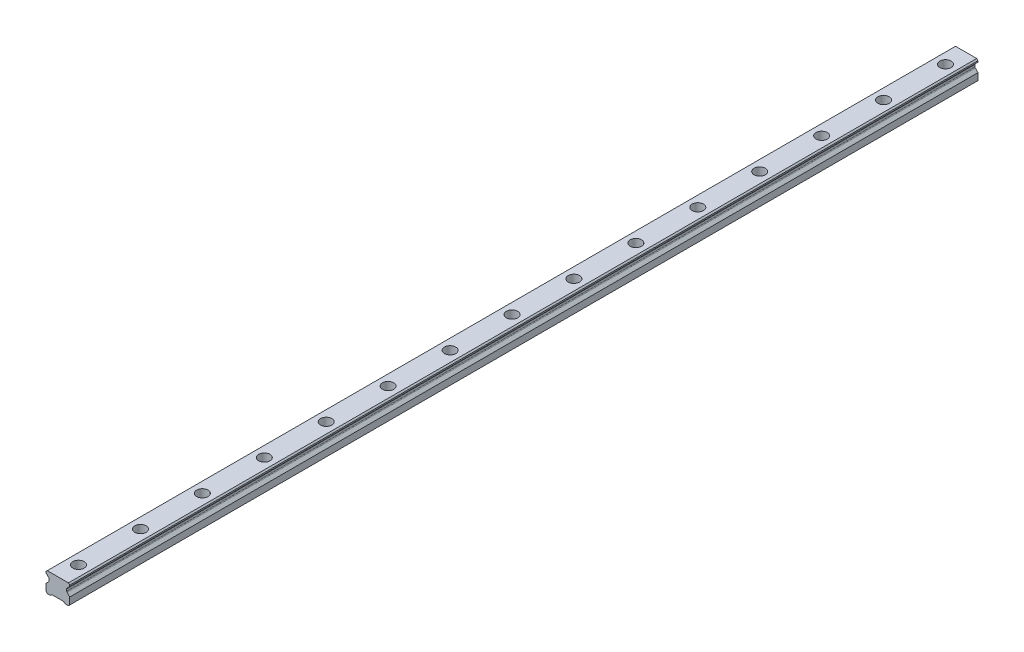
ISO-10303-21;
HEADER;
FILE_DESCRIPTION(('STEP AP214'),'2;1');
FILE_NAME('part.step','',(''),(''),'','','');
FILE_SCHEMA(('AUTOMOTIVE_DESIGN { 1 0 10303 214 1 1 1 1 }'));
ENDSEC;
DATA;
#1=APPLICATION_CONTEXT('core data for automotive mechanical design processes');
#2=APPLICATION_PROTOCOL_DEFINITION('international standard','automotive_design',2000,#1);
#3=PRODUCT_CONTEXT('',#1,'mechanical');
#4=PRODUCT('Part','Part','',(#3));
#5=PRODUCT_RELATED_PRODUCT_CATEGORY('part','',(#4));
#6=PRODUCT_DEFINITION_FORMATION('','',#4);
#7=PRODUCT_DEFINITION_CONTEXT('part definition',#1,'design');
#8=PRODUCT_DEFINITION('design','',#6,#7);
#9=PRODUCT_DEFINITION_SHAPE('','',#8);
#10=(LENGTH_UNIT() NAMED_UNIT(*) SI_UNIT(.MILLI.,.METRE.));
#11=(NAMED_UNIT(*) PLANE_ANGLE_UNIT() SI_UNIT($,.RADIAN.));
#12=(NAMED_UNIT(*) SI_UNIT($,.STERADIAN.) SOLID_ANGLE_UNIT());
#13=UNCERTAINTY_MEASURE_WITH_UNIT(LENGTH_MEASURE(1.E-05),#10,'distance_accuracy_value','');
#14=(GEOMETRIC_REPRESENTATION_CONTEXT(3) GLOBAL_UNCERTAINTY_ASSIGNED_CONTEXT((#13)) GLOBAL_UNIT_ASSIGNED_CONTEXT((#10,
#11,#12)) REPRESENTATION_CONTEXT('',''));
#15=CARTESIAN_POINT('',(0.,0.,0.));
#16=DIRECTION('',(0.,0.,1.));
#17=DIRECTION('',(1.,0.,0.));
#18=AXIS2_PLACEMENT_3D('',#15,#16,#17);
#19=CARTESIAN_POINT('',(0.,10.2,-420.));
#20=DIRECTION('',(0.,1.,0.));
#21=DIRECTION('',(0.,0.,1.));
#22=AXIS2_PLACEMENT_3D('',#19,#20,#21);
#23=PLANE('',#22);
#24=CARTESIAN_POINT('',(0.,10.2,-420.));
#25=DIRECTION('',(0.,1.,0.));
#26=DIRECTION('',(0.,0.,1.));
#27=AXIS2_PLACEMENT_3D('',#24,#25,#26);
#28=CIRCLE('',#27,3.5);
#29=CARTESIAN_POINT('',(0.,10.2,-416.5));
#30=VERTEX_POINT('',#29);
#31=EDGE_CURVE('E463',#30,#30,#28,.T.);
#32=ORIENTED_EDGE('',*,*,#31,.F.);
#33=EDGE_LOOP('',(#32));
#34=FACE_BOUND('',#33,.T.);
#35=CARTESIAN_POINT('',(0.,10.2,-420.));
#36=DIRECTION('',(0.,1.,0.));
#37=DIRECTION('',(0.,0.,1.));
#38=AXIS2_PLACEMENT_3D('',#35,#36,#37);
#39=CIRCLE('',#38,5.5);
#40=CARTESIAN_POINT('',(0.,10.2,-414.5));
#41=VERTEX_POINT('',#40);
#42=EDGE_CURVE('E11',#41,#41,#39,.T.);
#43=ORIENTED_EDGE('',*,*,#42,.T.);
#44=EDGE_LOOP('',(#43));
#45=FACE_BOUND('',#44,.T.);
#46=ADVANCED_FACE('F39',(#34,#45),#23,.T.);
#47=CARTESIAN_POINT('',(0.,10.2,-420.));
#48=DIRECTION('',(0.,1.,0.));
#49=DIRECTION('',(0.,0.,1.));
#50=AXIS2_PLACEMENT_3D('',#47,#48,#49);
#51=CYLINDRICAL_SURFACE('',#50,5.5);
#52=ORIENTED_EDGE('',*,*,#42,.F.);
#53=EDGE_LOOP('',(#52));
#54=FACE_BOUND('',#53,.T.);
#55=CARTESIAN_POINT('',(0.,19.2,-420.));
#56=DIRECTION('',(0.,1.,0.));
#57=DIRECTION('',(0.,0.,1.));
#58=AXIS2_PLACEMENT_3D('',#55,#56,#57);
#59=CIRCLE('',#58,5.5);
#60=CARTESIAN_POINT('',(0.,19.2,-414.5));
#61=VERTEX_POINT('',#60);
#62=EDGE_CURVE('E48',#61,#61,#59,.T.);
#63=ORIENTED_EDGE('',*,*,#62,.T.);
#64=EDGE_LOOP('',(#63));
#65=FACE_BOUND('',#64,.T.);
#66=ADVANCED_FACE('F765',(#54,#65),#51,.F.);
#67=CARTESIAN_POINT('',(0.,10.2,-360.));
#68=DIRECTION('',(0.,1.,0.));
#69=DIRECTION('',(0.,0.,1.));
#70=AXIS2_PLACEMENT_3D('',#67,#68,#69);
#71=PLANE('',#70);
#72=CARTESIAN_POINT('',(0.,10.2,-360.));
#73=DIRECTION('',(0.,1.,0.));
#74=DIRECTION('',(0.,0.,1.));
#75=AXIS2_PLACEMENT_3D('',#72,#73,#74);
#76=CIRCLE('',#75,3.5);
#77=CARTESIAN_POINT('',(0.,10.2,-356.5));
#78=VERTEX_POINT('',#77);
#79=EDGE_CURVE('E468',#78,#78,#76,.T.);
#80=ORIENTED_EDGE('',*,*,#79,.F.);
#81=EDGE_LOOP('',(#80));
#82=FACE_BOUND('',#81,.T.);
#83=CARTESIAN_POINT('',(0.,10.2,-360.));
#84=DIRECTION('',(0.,1.,0.));
#85=DIRECTION('',(0.,0.,1.));
#86=AXIS2_PLACEMENT_3D('',#83,#84,#85);
#87=CIRCLE('',#86,5.5);
#88=CARTESIAN_POINT('',(0.,10.2,-354.5));
#89=VERTEX_POINT('',#88);
#90=EDGE_CURVE('E447',#89,#89,#87,.T.);
#91=ORIENTED_EDGE('',*,*,#90,.T.);
#92=EDGE_LOOP('',(#91));
#93=FACE_BOUND('',#92,.T.);
#94=ADVANCED_FACE('F767',(#82,#93),#71,.T.);
#95=CARTESIAN_POINT('',(0.,10.2,-360.));
#96=DIRECTION('',(0.,1.,0.));
#97=DIRECTION('',(0.,0.,1.));
#98=AXIS2_PLACEMENT_3D('',#95,#96,#97);
#99=CYLINDRICAL_SURFACE('',#98,5.5);
#100=ORIENTED_EDGE('',*,*,#90,.F.);
#101=EDGE_LOOP('',(#100));
#102=FACE_BOUND('',#101,.T.);
#103=CARTESIAN_POINT('',(0.,19.2,-360.));
#104=DIRECTION('',(0.,1.,0.));
#105=DIRECTION('',(0.,0.,1.));
#106=AXIS2_PLACEMENT_3D('',#103,#104,#105);
#107=CIRCLE('',#106,5.5);
#108=CARTESIAN_POINT('',(0.,19.2,-354.5));
#109=VERTEX_POINT('',#108);
#110=EDGE_CURVE('E443',#109,#109,#107,.T.);
#111=ORIENTED_EDGE('',*,*,#110,.T.);
#112=EDGE_LOOP('',(#111));
#113=FACE_BOUND('',#112,.T.);
#114=ADVANCED_FACE('F773',(#102,#113),#99,.F.);
#115=CARTESIAN_POINT('',(0.,10.2,-300.));
#116=DIRECTION('',(0.,1.,0.));
#117=DIRECTION('',(0.,0.,1.));
#118=AXIS2_PLACEMENT_3D('',#115,#116,#117);
#119=PLANE('',#118);
#120=CARTESIAN_POINT('',(0.,10.2,-300.));
#121=DIRECTION('',(0.,1.,0.));
#122=DIRECTION('',(0.,0.,1.));
#123=AXIS2_PLACEMENT_3D('',#120,#121,#122);
#124=CIRCLE('',#123,3.5);
#125=CARTESIAN_POINT('',(0.,10.2,-296.5));
#126=VERTEX_POINT('',#125);
#127=EDGE_CURVE('E473',#126,#126,#124,.T.);
#128=ORIENTED_EDGE('',*,*,#127,.F.);
#129=EDGE_LOOP('',(#128));
#130=FACE_BOUND('',#129,.T.);
#131=CARTESIAN_POINT('',(0.,10.2,-300.));
#132=DIRECTION('',(0.,1.,0.));
#133=DIRECTION('',(0.,0.,1.));
#134=AXIS2_PLACEMENT_3D('',#131,#132,#133);
#135=CIRCLE('',#134,5.5);
#136=CARTESIAN_POINT('',(0.,10.2,-294.5));
#137=VERTEX_POINT('',#136);
#138=EDGE_CURVE('E439',#137,#137,#135,.T.);
#139=ORIENTED_EDGE('',*,*,#138,.T.);
#140=EDGE_LOOP('',(#139));
#141=FACE_BOUND('',#140,.T.);
#142=ADVANCED_FACE('F781',(#130,#141),#119,.T.);
#143=CARTESIAN_POINT('',(0.,10.2,-300.));
#144=DIRECTION('',(0.,1.,0.));
#145=DIRECTION('',(0.,0.,1.));
#146=AXIS2_PLACEMENT_3D('',#143,#144,#145);
#147=CYLINDRICAL_SURFACE('',#146,5.5);
#148=ORIENTED_EDGE('',*,*,#138,.F.);
#149=EDGE_LOOP('',(#148));
#150=FACE_BOUND('',#149,.T.);
#151=CARTESIAN_POINT('',(0.,19.2,-300.));
#152=DIRECTION('',(0.,1.,0.));
#153=DIRECTION('',(0.,0.,1.));
#154=AXIS2_PLACEMENT_3D('',#151,#152,#153);
#155=CIRCLE('',#154,5.5);
#156=CARTESIAN_POINT('',(0.,19.2,-294.5));
#157=VERTEX_POINT('',#156);
#158=EDGE_CURVE('E435',#157,#157,#155,.T.);
#159=ORIENTED_EDGE('',*,*,#158,.T.);
#160=EDGE_LOOP('',(#159));
#161=FACE_BOUND('',#160,.T.);
#162=ADVANCED_FACE('F785',(#150,#161),#147,.F.);
#163=CARTESIAN_POINT('',(0.,10.2,-240.));
#164=DIRECTION('',(0.,1.,0.));
#165=DIRECTION('',(0.,0.,1.));
#166=AXIS2_PLACEMENT_3D('',#163,#164,#165);
#167=PLANE('',#166);
#168=CARTESIAN_POINT('',(0.,10.2,-240.));
#169=DIRECTION('',(0.,1.,0.));
#170=DIRECTION('',(0.,0.,1.));
#171=AXIS2_PLACEMENT_3D('',#168,#169,#170);
#172=CIRCLE('',#171,3.5);
#173=CARTESIAN_POINT('',(0.,10.2,-236.5));
#174=VERTEX_POINT('',#173);
#175=EDGE_CURVE('E478',#174,#174,#172,.T.);
#176=ORIENTED_EDGE('',*,*,#175,.F.);
#177=EDGE_LOOP('',(#176));
#178=FACE_BOUND('',#177,.T.);
#179=CARTESIAN_POINT('',(0.,10.2,-240.));
#180=DIRECTION('',(0.,1.,0.));
#181=DIRECTION('',(0.,0.,1.));
#182=AXIS2_PLACEMENT_3D('',#179,#180,#181);
#183=CIRCLE('',#182,5.5);
#184=CARTESIAN_POINT('',(0.,10.2,-234.5));
#185=VERTEX_POINT('',#184);
#186=EDGE_CURVE('E431',#185,#185,#183,.T.);
#187=ORIENTED_EDGE('',*,*,#186,.T.);
#188=EDGE_LOOP('',(#187));
#189=FACE_BOUND('',#188,.T.);
#190=ADVANCED_FACE('F789',(#178,#189),#167,.T.);
#191=CARTESIAN_POINT('',(0.,10.2,-240.));
#192=DIRECTION('',(0.,1.,0.));
#193=DIRECTION('',(0.,0.,1.));
#194=AXIS2_PLACEMENT_3D('',#191,#192,#193);
#195=CYLINDRICAL_SURFACE('',#194,5.5);
#196=ORIENTED_EDGE('',*,*,#186,.F.);
#197=EDGE_LOOP('',(#196));
#198=FACE_BOUND('',#197,.T.);
#199=CARTESIAN_POINT('',(0.,19.2,-240.));
#200=DIRECTION('',(0.,1.,0.));
#201=DIRECTION('',(0.,0.,1.));
#202=AXIS2_PLACEMENT_3D('',#199,#200,#201);
#203=CIRCLE('',#202,5.5);
#204=CARTESIAN_POINT('',(0.,19.2,-234.5));
#205=VERTEX_POINT('',#204);
#206=EDGE_CURVE('E427',#205,#205,#203,.T.);
#207=ORIENTED_EDGE('',*,*,#206,.T.);
#208=EDGE_LOOP('',(#207));
#209=FACE_BOUND('',#208,.T.);
#210=ADVANCED_FACE('F793',(#198,#209),#195,.F.);
#211=CARTESIAN_POINT('',(0.,10.2,-180.));
#212=DIRECTION('',(0.,1.,0.));
#213=DIRECTION('',(0.,0.,1.));
#214=AXIS2_PLACEMENT_3D('',#211,#212,#213);
#215=PLANE('',#214);
#216=CARTESIAN_POINT('',(0.,10.2,-180.));
#217=DIRECTION('',(0.,1.,0.));
#218=DIRECTION('',(0.,0.,1.));
#219=AXIS2_PLACEMENT_3D('',#216,#217,#218);
#220=CIRCLE('',#219,3.5);
#221=CARTESIAN_POINT('',(0.,10.2,-176.5));
#222=VERTEX_POINT('',#221);
#223=EDGE_CURVE('E483',#222,#222,#220,.T.);
#224=ORIENTED_EDGE('',*,*,#223,.F.);
#225=EDGE_LOOP('',(#224));
#226=FACE_BOUND('',#225,.T.);
#227=CARTESIAN_POINT('',(0.,10.2,-180.));
#228=DIRECTION('',(0.,1.,0.));
#229=DIRECTION('',(0.,0.,1.));
#230=AXIS2_PLACEMENT_3D('',#227,#228,#229);
#231=CIRCLE('',#230,5.5);
#232=CARTESIAN_POINT('',(0.,10.2,-174.5));
#233=VERTEX_POINT('',#232);
#234=EDGE_CURVE('E423',#233,#233,#231,.T.);
#235=ORIENTED_EDGE('',*,*,#234,.T.);
#236=EDGE_LOOP('',(#235));
#237=FACE_BOUND('',#236,.T.);
#238=ADVANCED_FACE('F797',(#226,#237),#215,.T.);
#239=CARTESIAN_POINT('',(0.,10.2,-180.));
#240=DIRECTION('',(0.,1.,0.));
#241=DIRECTION('',(0.,0.,1.));
#242=AXIS2_PLACEMENT_3D('',#239,#240,#241);
#243=CYLINDRICAL_SURFACE('',#242,5.5);
#244=ORIENTED_EDGE('',*,*,#234,.F.);
#245=EDGE_LOOP('',(#244));
#246=FACE_BOUND('',#245,.T.);
#247=CARTESIAN_POINT('',(0.,19.2,-180.));
#248=DIRECTION('',(0.,1.,0.));
#249=DIRECTION('',(0.,0.,1.));
#250=AXIS2_PLACEMENT_3D('',#247,#248,#249);
#251=CIRCLE('',#250,5.5);
#252=CARTESIAN_POINT('',(0.,19.2,-174.5));
#253=VERTEX_POINT('',#252);
#254=EDGE_CURVE('E419',#253,#253,#251,.T.);
#255=ORIENTED_EDGE('',*,*,#254,.T.);
#256=EDGE_LOOP('',(#255));
#257=FACE_BOUND('',#256,.T.);
#258=ADVANCED_FACE('F801',(#246,#257),#243,.F.);
#259=CARTESIAN_POINT('',(0.,10.2,-120.));
#260=DIRECTION('',(0.,1.,0.));
#261=DIRECTION('',(0.,0.,1.));
#262=AXIS2_PLACEMENT_3D('',#259,#260,#261);
#263=PLANE('',#262);
#264=CARTESIAN_POINT('',(0.,10.2,-120.));
#265=DIRECTION('',(0.,1.,0.));
#266=DIRECTION('',(0.,0.,1.));
#267=AXIS2_PLACEMENT_3D('',#264,#265,#266);
#268=CIRCLE('',#267,3.5);
#269=CARTESIAN_POINT('',(0.,10.2,-116.5));
#270=VERTEX_POINT('',#269);
#271=EDGE_CURVE('E488',#270,#270,#268,.T.);
#272=ORIENTED_EDGE('',*,*,#271,.F.);
#273=EDGE_LOOP('',(#272));
#274=FACE_BOUND('',#273,.T.);
#275=CARTESIAN_POINT('',(0.,10.2,-120.));
#276=DIRECTION('',(0.,1.,0.));
#277=DIRECTION('',(0.,0.,1.));
#278=AXIS2_PLACEMENT_3D('',#275,#276,#277);
#279=CIRCLE('',#278,5.5);
#280=CARTESIAN_POINT('',(0.,10.2,-114.5));
#281=VERTEX_POINT('',#280);
#282=EDGE_CURVE('E415',#281,#281,#279,.T.);
#283=ORIENTED_EDGE('',*,*,#282,.T.);
#284=EDGE_LOOP('',(#283));
#285=FACE_BOUND('',#284,.T.);
#286=ADVANCED_FACE('F805',(#274,#285),#263,.T.);
#287=CARTESIAN_POINT('',(0.,10.2,-120.));
#288=DIRECTION('',(0.,1.,0.));
#289=DIRECTION('',(0.,0.,1.));
#290=AXIS2_PLACEMENT_3D('',#287,#288,#289);
#291=CYLINDRICAL_SURFACE('',#290,5.5);
#292=ORIENTED_EDGE('',*,*,#282,.F.);
#293=EDGE_LOOP('',(#292));
#294=FACE_BOUND('',#293,.T.);
#295=CARTESIAN_POINT('',(0.,19.2,-120.));
#296=DIRECTION('',(0.,1.,0.));
#297=DIRECTION('',(0.,0.,1.));
#298=AXIS2_PLACEMENT_3D('',#295,#296,#297);
#299=CIRCLE('',#298,5.5);
#300=CARTESIAN_POINT('',(0.,19.2,-114.5));
#301=VERTEX_POINT('',#300);
#302=EDGE_CURVE('E411',#301,#301,#299,.T.);
#303=ORIENTED_EDGE('',*,*,#302,.T.);
#304=EDGE_LOOP('',(#303));
#305=FACE_BOUND('',#304,.T.);
#306=ADVANCED_FACE('F809',(#294,#305),#291,.F.);
#307=CARTESIAN_POINT('',(0.,10.2,-60.));
#308=DIRECTION('',(0.,1.,0.));
#309=DIRECTION('',(0.,0.,1.));
#310=AXIS2_PLACEMENT_3D('',#307,#308,#309);
#311=PLANE('',#310);
#312=CARTESIAN_POINT('',(0.,10.2,-60.));
#313=DIRECTION('',(0.,1.,0.));
#314=DIRECTION('',(0.,0.,1.));
#315=AXIS2_PLACEMENT_3D('',#312,#313,#314);
#316=CIRCLE('',#315,3.5);
#317=CARTESIAN_POINT('',(0.,10.2,-56.5));
#318=VERTEX_POINT('',#317);
#319=EDGE_CURVE('E493',#318,#318,#316,.T.);
#320=ORIENTED_EDGE('',*,*,#319,.F.);
#321=EDGE_LOOP('',(#320));
#322=FACE_BOUND('',#321,.T.);
#323=CARTESIAN_POINT('',(0.,10.2,-60.));
#324=DIRECTION('',(0.,1.,0.));
#325=DIRECTION('',(0.,0.,1.));
#326=AXIS2_PLACEMENT_3D('',#323,#324,#325);
#327=CIRCLE('',#326,5.5);
#328=CARTESIAN_POINT('',(0.,10.2,-54.5));
#329=VERTEX_POINT('',#328);
#330=EDGE_CURVE('E407',#329,#329,#327,.T.);
#331=ORIENTED_EDGE('',*,*,#330,.T.);
#332=EDGE_LOOP('',(#331));
#333=FACE_BOUND('',#332,.T.);
#334=ADVANCED_FACE('F813',(#322,#333),#311,.T.);
#335=CARTESIAN_POINT('',(0.,10.2,-60.));
#336=DIRECTION('',(0.,1.,0.));
#337=DIRECTION('',(0.,0.,1.));
#338=AXIS2_PLACEMENT_3D('',#335,#336,#337);
#339=CYLINDRICAL_SURFACE('',#338,5.5);
#340=ORIENTED_EDGE('',*,*,#330,.F.);
#341=EDGE_LOOP('',(#340));
#342=FACE_BOUND('',#341,.T.);
#343=CARTESIAN_POINT('',(0.,19.2,-60.));
#344=DIRECTION('',(0.,1.,0.));
#345=DIRECTION('',(0.,0.,1.));
#346=AXIS2_PLACEMENT_3D('',#343,#344,#345);
#347=CIRCLE('',#346,5.5);
#348=CARTESIAN_POINT('',(0.,19.2,-54.5));
#349=VERTEX_POINT('',#348);
#350=EDGE_CURVE('E403',#349,#349,#347,.T.);
#351=ORIENTED_EDGE('',*,*,#350,.T.);
#352=EDGE_LOOP('',(#351));
#353=FACE_BOUND('',#352,.T.);
#354=ADVANCED_FACE('F817',(#342,#353),#339,.F.);
#355=CARTESIAN_POINT('',(0.,10.2,0.));
#356=DIRECTION('',(0.,1.,0.));
#357=DIRECTION('',(0.,0.,1.));
#358=AXIS2_PLACEMENT_3D('',#355,#356,#357);
#359=PLANE('',#358);
#360=CARTESIAN_POINT('',(0.,10.2,0.));
#361=DIRECTION('',(0.,1.,0.));
#362=DIRECTION('',(0.,0.,1.));
#363=AXIS2_PLACEMENT_3D('',#360,#361,#362);
#364=CIRCLE('',#363,3.5);
#365=CARTESIAN_POINT('',(0.,10.2,3.5));
#366=VERTEX_POINT('',#365);
#367=EDGE_CURVE('E498',#366,#366,#364,.T.);
#368=ORIENTED_EDGE('',*,*,#367,.F.);
#369=EDGE_LOOP('',(#368));
#370=FACE_BOUND('',#369,.T.);
#371=CARTESIAN_POINT('',(0.,10.2,0.));
#372=DIRECTION('',(0.,1.,0.));
#373=DIRECTION('',(0.,0.,1.));
#374=AXIS2_PLACEMENT_3D('',#371,#372,#373);
#375=CIRCLE('',#374,5.5);
#376=CARTESIAN_POINT('',(0.,10.2,5.5));
#377=VERTEX_POINT('',#376);
#378=EDGE_CURVE('E399',#377,#377,#375,.T.);
#379=ORIENTED_EDGE('',*,*,#378,.T.);
#380=EDGE_LOOP('',(#379));
#381=FACE_BOUND('',#380,.T.);
#382=ADVANCED_FACE('F821',(#370,#381),#359,.T.);
#383=CARTESIAN_POINT('',(0.,10.2,0.));
#384=DIRECTION('',(0.,1.,0.));
#385=DIRECTION('',(0.,0.,1.));
#386=AXIS2_PLACEMENT_3D('',#383,#384,#385);
#387=CYLINDRICAL_SURFACE('',#386,5.5);
#388=ORIENTED_EDGE('',*,*,#378,.F.);
#389=EDGE_LOOP('',(#388));
#390=FACE_BOUND('',#389,.T.);
#391=CARTESIAN_POINT('',(0.,19.2,0.));
#392=DIRECTION('',(0.,1.,0.));
#393=DIRECTION('',(0.,0.,1.));
#394=AXIS2_PLACEMENT_3D('',#391,#392,#393);
#395=CIRCLE('',#394,5.5);
#396=CARTESIAN_POINT('',(0.,19.2,5.5));
#397=VERTEX_POINT('',#396);
#398=EDGE_CURVE('E395',#397,#397,#395,.T.);
#399=ORIENTED_EDGE('',*,*,#398,.T.);
#400=EDGE_LOOP('',(#399));
#401=FACE_BOUND('',#400,.T.);
#402=ADVANCED_FACE('F733',(#390,#401),#387,.F.);
#403=CARTESIAN_POINT('',(0.,10.2,60.));
#404=DIRECTION('',(0.,1.,0.));
#405=DIRECTION('',(0.,0.,1.));
#406=AXIS2_PLACEMENT_3D('',#403,#404,#405);
#407=PLANE('',#406);
#408=CARTESIAN_POINT('',(0.,10.2,60.));
#409=DIRECTION('',(0.,1.,0.));
#410=DIRECTION('',(0.,0.,1.));
#411=AXIS2_PLACEMENT_3D('',#408,#409,#410);
#412=CIRCLE('',#411,3.5);
#413=CARTESIAN_POINT('',(0.,10.2,63.5));
#414=VERTEX_POINT('',#413);
#415=EDGE_CURVE('E503',#414,#414,#412,.T.);
#416=ORIENTED_EDGE('',*,*,#415,.F.);
#417=EDGE_LOOP('',(#416));
#418=FACE_BOUND('',#417,.T.);
#419=CARTESIAN_POINT('',(0.,10.2,60.));
#420=DIRECTION('',(0.,1.,0.));
#421=DIRECTION('',(0.,0.,1.));
#422=AXIS2_PLACEMENT_3D('',#419,#420,#421);
#423=CIRCLE('',#422,5.5);
#424=CARTESIAN_POINT('',(0.,10.2,65.5));
#425=VERTEX_POINT('',#424);
#426=EDGE_CURVE('E391',#425,#425,#423,.T.);
#427=ORIENTED_EDGE('',*,*,#426,.T.);
#428=EDGE_LOOP('',(#427));
#429=FACE_BOUND('',#428,.T.);
#430=ADVANCED_FACE('F729',(#418,#429),#407,.T.);
#431=CARTESIAN_POINT('',(0.,10.2,60.));
#432=DIRECTION('',(0.,1.,0.));
#433=DIRECTION('',(0.,0.,1.));
#434=AXIS2_PLACEMENT_3D('',#431,#432,#433);
#435=CYLINDRICAL_SURFACE('',#434,5.5);
#436=ORIENTED_EDGE('',*,*,#426,.F.);
#437=EDGE_LOOP('',(#436));
#438=FACE_BOUND('',#437,.T.);
#439=CARTESIAN_POINT('',(0.,19.2,60.));
#440=DIRECTION('',(0.,1.,0.));
#441=DIRECTION('',(0.,0.,1.));
#442=AXIS2_PLACEMENT_3D('',#439,#440,#441);
#443=CIRCLE('',#442,5.5);
#444=CARTESIAN_POINT('',(0.,19.2,65.5));
#445=VERTEX_POINT('',#444);
#446=EDGE_CURVE('E387',#445,#445,#443,.T.);
#447=ORIENTED_EDGE('',*,*,#446,.T.);
#448=EDGE_LOOP('',(#447));
#449=FACE_BOUND('',#448,.T.);
#450=ADVANCED_FACE('F732',(#438,#449),#435,.F.);
#451=CARTESIAN_POINT('',(0.,10.2,120.));
#452=DIRECTION('',(0.,1.,0.));
#453=DIRECTION('',(0.,0.,1.));
#454=AXIS2_PLACEMENT_3D('',#451,#452,#453);
#455=PLANE('',#454);
#456=CARTESIAN_POINT('',(0.,10.2,120.));
#457=DIRECTION('',(0.,1.,0.));
#458=DIRECTION('',(0.,0.,1.));
#459=AXIS2_PLACEMENT_3D('',#456,#457,#458);
#460=CIRCLE('',#459,3.5);
#461=CARTESIAN_POINT('',(0.,10.2,123.5));
#462=VERTEX_POINT('',#461);
#463=EDGE_CURVE('E508',#462,#462,#460,.T.);
#464=ORIENTED_EDGE('',*,*,#463,.F.);
#465=EDGE_LOOP('',(#464));
#466=FACE_BOUND('',#465,.T.);
#467=CARTESIAN_POINT('',(0.,10.2,120.));
#468=DIRECTION('',(0.,1.,0.));
#469=DIRECTION('',(0.,0.,1.));
#470=AXIS2_PLACEMENT_3D('',#467,#468,#469);
#471=CIRCLE('',#470,5.5);
#472=CARTESIAN_POINT('',(0.,10.2,125.5));
#473=VERTEX_POINT('',#472);
#474=EDGE_CURVE('E383',#473,#473,#471,.T.);
#475=ORIENTED_EDGE('',*,*,#474,.T.);
#476=EDGE_LOOP('',(#475));
#477=FACE_BOUND('',#476,.T.);
#478=ADVANCED_FACE('F739',(#466,#477),#455,.T.);
#479=CARTESIAN_POINT('',(0.,10.2,120.));
#480=DIRECTION('',(0.,1.,0.));
#481=DIRECTION('',(0.,0.,1.));
#482=AXIS2_PLACEMENT_3D('',#479,#480,#481);
#483=CYLINDRICAL_SURFACE('',#482,5.5);
#484=ORIENTED_EDGE('',*,*,#474,.F.);
#485=EDGE_LOOP('',(#484));
#486=FACE_BOUND('',#485,.T.);
#487=CARTESIAN_POINT('',(0.,19.2,120.));
#488=DIRECTION('',(0.,1.,0.));
#489=DIRECTION('',(0.,0.,1.));
#490=AXIS2_PLACEMENT_3D('',#487,#488,#489);
#491=CIRCLE('',#490,5.5);
#492=CARTESIAN_POINT('',(0.,19.2,125.5));
#493=VERTEX_POINT('',#492);
#494=EDGE_CURVE('E379',#493,#493,#491,.T.);
#495=ORIENTED_EDGE('',*,*,#494,.T.);
#496=EDGE_LOOP('',(#495));
#497=FACE_BOUND('',#496,.T.);
#498=ADVANCED_FACE('F831',(#486,#497),#483,.F.);
#499=CARTESIAN_POINT('',(0.,10.2,180.));
#500=DIRECTION('',(0.,1.,0.));
#501=DIRECTION('',(0.,0.,1.));
#502=AXIS2_PLACEMENT_3D('',#499,#500,#501);
#503=PLANE('',#502);
#504=CARTESIAN_POINT('',(0.,10.2,180.));
#505=DIRECTION('',(0.,1.,0.));
#506=DIRECTION('',(0.,0.,1.));
#507=AXIS2_PLACEMENT_3D('',#504,#505,#506);
#508=CIRCLE('',#507,3.5);
#509=CARTESIAN_POINT('',(0.,10.2,183.5));
#510=VERTEX_POINT('',#509);
#511=EDGE_CURVE('E512',#510,#510,#508,.T.);
#512=ORIENTED_EDGE('',*,*,#511,.F.);
#513=EDGE_LOOP('',(#512));
#514=FACE_BOUND('',#513,.T.);
#515=CARTESIAN_POINT('',(0.,10.2,180.));
#516=DIRECTION('',(0.,1.,0.));
#517=DIRECTION('',(0.,0.,1.));
#518=AXIS2_PLACEMENT_3D('',#515,#516,#517);
#519=CIRCLE('',#518,5.5);
#520=CARTESIAN_POINT('',(0.,10.2,185.5));
#521=VERTEX_POINT('',#520);
#522=EDGE_CURVE('E375',#521,#521,#519,.T.);
#523=ORIENTED_EDGE('',*,*,#522,.T.);
#524=EDGE_LOOP('',(#523));
#525=FACE_BOUND('',#524,.T.);
#526=ADVANCED_FACE('F835',(#514,#525),#503,.T.);
#527=CARTESIAN_POINT('',(0.,10.2,180.));
#528=DIRECTION('',(0.,1.,0.));
#529=DIRECTION('',(0.,0.,1.));
#530=AXIS2_PLACEMENT_3D('',#527,#528,#529);
#531=CYLINDRICAL_SURFACE('',#530,5.5);
#532=ORIENTED_EDGE('',*,*,#522,.F.);
#533=EDGE_LOOP('',(#532));
#534=FACE_BOUND('',#533,.T.);
#535=CARTESIAN_POINT('',(0.,19.2,180.));
#536=DIRECTION('',(0.,1.,0.));
#537=DIRECTION('',(0.,0.,1.));
#538=AXIS2_PLACEMENT_3D('',#535,#536,#537);
#539=CIRCLE('',#538,5.5);
#540=CARTESIAN_POINT('',(0.,19.2,185.5));
#541=VERTEX_POINT('',#540);
#542=EDGE_CURVE('E371',#541,#541,#539,.T.);
#543=ORIENTED_EDGE('',*,*,#542,.T.);
#544=EDGE_LOOP('',(#543));
#545=FACE_BOUND('',#544,.T.);
#546=ADVANCED_FACE('F839',(#534,#545),#531,.F.);
#547=CARTESIAN_POINT('',(0.,10.2,240.));
#548=DIRECTION('',(0.,1.,0.));
#549=DIRECTION('',(0.,0.,1.));
#550=AXIS2_PLACEMENT_3D('',#547,#548,#549);
#551=PLANE('',#550);
#552=CARTESIAN_POINT('',(0.,10.2,240.));
#553=DIRECTION('',(0.,1.,0.));
#554=DIRECTION('',(0.,0.,1.));
#555=AXIS2_PLACEMENT_3D('',#552,#553,#554);
#556=CIRCLE('',#555,3.5);
#557=CARTESIAN_POINT('',(0.,10.2,243.5));
#558=VERTEX_POINT('',#557);
#559=EDGE_CURVE('E516',#558,#558,#556,.T.);
#560=ORIENTED_EDGE('',*,*,#559,.F.);
#561=EDGE_LOOP('',(#560));
#562=FACE_BOUND('',#561,.T.);
#563=CARTESIAN_POINT('',(0.,10.2,240.));
#564=DIRECTION('',(0.,1.,0.));
#565=DIRECTION('',(0.,0.,1.));
#566=AXIS2_PLACEMENT_3D('',#563,#564,#565);
#567=CIRCLE('',#566,5.5);
#568=CARTESIAN_POINT('',(0.,10.2,245.5));
#569=VERTEX_POINT('',#568);
#570=EDGE_CURVE('E367',#569,#569,#567,.T.);
#571=ORIENTED_EDGE('',*,*,#570,.T.);
#572=EDGE_LOOP('',(#571));
#573=FACE_BOUND('',#572,.T.);
#574=ADVANCED_FACE('F843',(#562,#573),#551,.T.);
#575=CARTESIAN_POINT('',(0.,10.2,240.));
#576=DIRECTION('',(0.,1.,0.));
#577=DIRECTION('',(0.,0.,1.));
#578=AXIS2_PLACEMENT_3D('',#575,#576,#577);
#579=CYLINDRICAL_SURFACE('',#578,5.5);
#580=ORIENTED_EDGE('',*,*,#570,.F.);
#581=EDGE_LOOP('',(#580));
#582=FACE_BOUND('',#581,.T.);
#583=CARTESIAN_POINT('',(0.,19.2,240.));
#584=DIRECTION('',(0.,1.,0.));
#585=DIRECTION('',(0.,0.,1.));
#586=AXIS2_PLACEMENT_3D('',#583,#584,#585);
#587=CIRCLE('',#586,5.5);
#588=CARTESIAN_POINT('',(0.,19.2,245.5));
#589=VERTEX_POINT('',#588);
#590=EDGE_CURVE('E363',#589,#589,#587,.T.);
#591=ORIENTED_EDGE('',*,*,#590,.T.);
#592=EDGE_LOOP('',(#591));
#593=FACE_BOUND('',#592,.T.);
#594=ADVANCED_FACE('F847',(#582,#593),#579,.F.);
#595=CARTESIAN_POINT('',(0.,10.2,300.));
#596=DIRECTION('',(0.,1.,0.));
#597=DIRECTION('',(0.,0.,1.));
#598=AXIS2_PLACEMENT_3D('',#595,#596,#597);
#599=PLANE('',#598);
#600=CARTESIAN_POINT('',(0.,10.2,300.));
#601=DIRECTION('',(0.,1.,0.));
#602=DIRECTION('',(0.,0.,1.));
#603=AXIS2_PLACEMENT_3D('',#600,#601,#602);
#604=CIRCLE('',#603,3.5);
#605=CARTESIAN_POINT('',(0.,10.2,303.5));
#606=VERTEX_POINT('',#605);
#607=EDGE_CURVE('E531',#606,#606,#604,.T.);
#608=ORIENTED_EDGE('',*,*,#607,.F.);
#609=EDGE_LOOP('',(#608));
#610=FACE_BOUND('',#609,.T.);
#611=CARTESIAN_POINT('',(0.,10.2,300.));
#612=DIRECTION('',(0.,1.,0.));
#613=DIRECTION('',(0.,0.,1.));
#614=AXIS2_PLACEMENT_3D('',#611,#612,#613);
#615=CIRCLE('',#614,5.5);
#616=CARTESIAN_POINT('',(0.,10.2,305.5));
#617=VERTEX_POINT('',#616);
#618=EDGE_CURVE('E359',#617,#617,#615,.T.);
#619=ORIENTED_EDGE('',*,*,#618,.T.);
#620=EDGE_LOOP('',(#619));
#621=FACE_BOUND('',#620,.T.);
#622=ADVANCED_FACE('F851',(#610,#621),#599,.T.);
#623=CARTESIAN_POINT('',(0.,10.2,300.));
#624=DIRECTION('',(0.,1.,0.));
#625=DIRECTION('',(0.,0.,1.));
#626=AXIS2_PLACEMENT_3D('',#623,#624,#625);
#627=CYLINDRICAL_SURFACE('',#626,5.5);
#628=ORIENTED_EDGE('',*,*,#618,.F.);
#629=EDGE_LOOP('',(#628));
#630=FACE_BOUND('',#629,.T.);
#631=CARTESIAN_POINT('',(0.,19.2,300.));
#632=DIRECTION('',(0.,1.,0.));
#633=DIRECTION('',(0.,0.,1.));
#634=AXIS2_PLACEMENT_3D('',#631,#632,#633);
#635=CIRCLE('',#634,5.5);
#636=CARTESIAN_POINT('',(0.,19.2,305.5));
#637=VERTEX_POINT('',#636);
#638=EDGE_CURVE('E355',#637,#637,#635,.T.);
#639=ORIENTED_EDGE('',*,*,#638,.T.);
#640=EDGE_LOOP('',(#639));
#641=FACE_BOUND('',#640,.T.);
#642=ADVANCED_FACE('F855',(#630,#641),#627,.F.);
#643=CARTESIAN_POINT('',(11.5,0.,440.));
#644=DIRECTION('',(0.,1.,0.));
#645=DIRECTION('',(-1.,0.,0.));
#646=AXIS2_PLACEMENT_3D('',#643,#644,#645);
#647=PLANE('',#646);
#648=DIRECTION('',(1.,0.,0.));
#649=VECTOR('',#648,1.);
#650=CARTESIAN_POINT('',(11.5,0.,-440.));
#651=LINE('',#650,#649);
#652=CARTESIAN_POINT('',(-10.2499999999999,0.,-440.));
#653=VERTEX_POINT('',#652);
#654=CARTESIAN_POINT('',(-7.,0.,-440.));
#655=VERTEX_POINT('',#654);
#656=EDGE_CURVE('E229',#653,#655,#651,.T.);
#657=ORIENTED_EDGE('',*,*,#656,.T.);
#658=DIRECTION('',(0.,0.,1.));
#659=VECTOR('',#658,1.);
#660=CARTESIAN_POINT('',(-7.,0.,-440.));
#661=LINE('',#660,#659);
#662=CARTESIAN_POINT('',(-7.,0.,440.));
#663=VERTEX_POINT('',#662);
#664=EDGE_CURVE('E572',#655,#663,#661,.T.);
#665=ORIENTED_EDGE('',*,*,#664,.T.);
#666=DIRECTION('',(1.,0.,0.));
#667=VECTOR('',#666,1.);
#668=CARTESIAN_POINT('',(11.5,0.,440.));
#669=LINE('',#668,#667);
#670=CARTESIAN_POINT('',(-10.2499999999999,0.,440.));
#671=VERTEX_POINT('',#670);
#672=EDGE_CURVE('E641',#671,#663,#669,.T.);
#673=ORIENTED_EDGE('',*,*,#672,.F.);
#674=DIRECTION('',(0.,0.,-1.));
#675=VECTOR('',#674,1.);
#676=CARTESIAN_POINT('',(-10.2499999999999,0.,440.));
#677=LINE('',#676,#675);
#678=EDGE_CURVE('E290',#671,#653,#677,.T.);
#679=ORIENTED_EDGE('',*,*,#678,.T.);
#680=EDGE_LOOP('',(#657,#665,#673,#679));
#681=FACE_BOUND('',#680,.T.);
#682=ADVANCED_FACE('F859',(#681),#647,.F.);
#683=CARTESIAN_POINT('',(-11.5,19.2,440.));
#684=DIRECTION('',(1.,0.,0.));
#685=DIRECTION('',(0.,1.,0.));
#686=AXIS2_PLACEMENT_3D('',#683,#684,#685);
#687=PLANE('',#686);
#688=DIRECTION('',(0.,-1.,0.));
#689=VECTOR('',#688,1.);
#690=CARTESIAN_POINT('',(-11.5,19.2,440.));
#691=LINE('',#690,#689);
#692=CARTESIAN_POINT('',(-11.5,17.95,440.));
#693=VERTEX_POINT('',#692);
#694=CARTESIAN_POINT('',(-11.5,16.7,440.));
#695=VERTEX_POINT('',#694);
#696=EDGE_CURVE('E637',#693,#695,#691,.T.);
#697=ORIENTED_EDGE('',*,*,#696,.F.);
#698=DIRECTION('',(0.,0.,-1.));
#699=VECTOR('',#698,1.);
#700=CARTESIAN_POINT('',(-11.5,17.95,440.));
#701=LINE('',#700,#699);
#702=CARTESIAN_POINT('',(-11.5,17.95,-440.));
#703=VERTEX_POINT('',#702);
#704=EDGE_CURVE('E252',#693,#703,#701,.T.);
#705=ORIENTED_EDGE('',*,*,#704,.T.);
#706=DIRECTION('',(0.,-1.,0.));
#707=VECTOR('',#706,1.);
#708=CARTESIAN_POINT('',(-11.5,19.2,-440.));
#709=LINE('',#708,#707);
#710=CARTESIAN_POINT('',(-11.5,16.7,-440.));
#711=VERTEX_POINT('',#710);
#712=EDGE_CURVE('E230',#703,#711,#709,.T.);
#713=ORIENTED_EDGE('',*,*,#712,.T.);
#714=DIRECTION('',(0.,0.,1.));
#715=VECTOR('',#714,1.);
#716=CARTESIAN_POINT('',(-11.5,16.7,-440.));
#717=LINE('',#716,#715);
#718=EDGE_CURVE('E593',#711,#695,#717,.T.);
#719=ORIENTED_EDGE('',*,*,#718,.T.);
#720=EDGE_LOOP('',(#697,#705,#713,#719));
#721=FACE_BOUND('',#720,.T.);
#722=ADVANCED_FACE('F665',(#721),#687,.F.);
#723=CARTESIAN_POINT('',(11.5,19.2,440.));
#724=DIRECTION('',(-1.,0.,0.));
#725=DIRECTION('',(0.,0.,1.));
#726=AXIS2_PLACEMENT_3D('',#723,#724,#725);
#727=PLANE('',#726);
#728=DIRECTION('',(0.,1.,0.));
#729=VECTOR('',#728,1.);
#730=CARTESIAN_POINT('',(11.5,19.2,440.));
#731=LINE('',#730,#729);
#732=CARTESIAN_POINT('',(11.5,1.24999999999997,440.));
#733=VERTEX_POINT('',#732);
#734=CARTESIAN_POINT('',(11.5,7.95,440.));
#735=VERTEX_POINT('',#734);
#736=EDGE_CURVE('E646',#733,#735,#731,.T.);
#737=ORIENTED_EDGE('',*,*,#736,.F.);
#738=DIRECTION('',(0.,0.,-1.));
#739=VECTOR('',#738,1.);
#740=CARTESIAN_POINT('',(11.5,1.24999999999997,440.));
#741=LINE('',#740,#739);
#742=CARTESIAN_POINT('',(11.5,1.24999999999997,-440.));
#743=VERTEX_POINT('',#742);
#744=EDGE_CURVE('E297',#733,#743,#741,.T.);
#745=ORIENTED_EDGE('',*,*,#744,.T.);
#746=DIRECTION('',(0.,1.,0.));
#747=VECTOR('',#746,1.);
#748=CARTESIAN_POINT('',(11.5,19.2,-440.));
#749=LINE('',#748,#747);
#750=CARTESIAN_POINT('',(11.5,7.95,-440.));
#751=VERTEX_POINT('',#750);
#752=EDGE_CURVE('E243',#743,#751,#749,.T.);
#753=ORIENTED_EDGE('',*,*,#752,.T.);
#754=DIRECTION('',(0.,0.,1.));
#755=VECTOR('',#754,1.);
#756=CARTESIAN_POINT('',(11.5,7.95,-440.));
#757=LINE('',#756,#755);
#758=EDGE_CURVE('E622',#751,#735,#757,.T.);
#759=ORIENTED_EDGE('',*,*,#758,.T.);
#760=EDGE_LOOP('',(#737,#745,#753,#759));
#761=FACE_BOUND('',#760,.T.);
#762=ADVANCED_FACE('F890',(#761),#727,.F.);
#763=CARTESIAN_POINT('',(-11.5,7.95,-440.));
#764=VERTEX_POINT('',#763);
#765=CARTESIAN_POINT('',(-11.5,1.24999999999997,-440.));
#766=VERTEX_POINT('',#765);
#767=EDGE_CURVE('E239',#764,#766,#709,.T.);
#768=ORIENTED_EDGE('',*,*,#767,.T.);
#769=DIRECTION('',(0.,0.,1.));
#770=VECTOR('',#769,1.);
#771=CARTESIAN_POINT('',(-11.5,1.24999999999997,440.));
#772=LINE('',#771,#770);
#773=CARTESIAN_POINT('',(-11.5,1.24999999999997,440.));
#774=VERTEX_POINT('',#773);
#775=EDGE_CURVE('E294',#766,#774,#772,.T.);
#776=ORIENTED_EDGE('',*,*,#775,.T.);
#777=CARTESIAN_POINT('',(-11.5,7.95,440.));
#778=VERTEX_POINT('',#777);
#779=EDGE_CURVE('E251',#778,#774,#691,.T.);
#780=ORIENTED_EDGE('',*,*,#779,.F.);
#781=DIRECTION('',(0.,0.,1.));
#782=VECTOR('',#781,1.);
#783=CARTESIAN_POINT('',(-11.5,7.95,-440.));
#784=LINE('',#783,#782);
#785=EDGE_CURVE('E604',#764,#778,#784,.T.);
#786=ORIENTED_EDGE('',*,*,#785,.F.);
#787=EDGE_LOOP('',(#768,#776,#780,#786));
#788=FACE_BOUND('',#787,.T.);
#789=ADVANCED_FACE('F693',(#788),#687,.F.);
#790=CARTESIAN_POINT('',(7.,0.,440.));
#791=VERTEX_POINT('',#790);
#792=CARTESIAN_POINT('',(10.25,0.,440.));
#793=VERTEX_POINT('',#792);
#794=EDGE_CURVE('E219',#791,#793,#669,.T.);
#795=ORIENTED_EDGE('',*,*,#794,.F.);
#796=DIRECTION('',(0.,0.,1.));
#797=VECTOR('',#796,1.);
#798=CARTESIAN_POINT('',(7.,0.,-440.));
#799=LINE('',#798,#797);
#800=CARTESIAN_POINT('',(7.,0.,-440.));
#801=VERTEX_POINT('',#800);
#802=EDGE_CURVE('E206',#801,#791,#799,.T.);
#803=ORIENTED_EDGE('',*,*,#802,.F.);
#804=CARTESIAN_POINT('',(10.25,0.,-440.));
#805=VERTEX_POINT('',#804);
#806=EDGE_CURVE('E217',#801,#805,#651,.T.);
#807=ORIENTED_EDGE('',*,*,#806,.T.);
#808=DIRECTION('',(0.,0.,1.));
#809=VECTOR('',#808,1.);
#810=CARTESIAN_POINT('',(10.25,0.,440.));
#811=LINE('',#810,#809);
#812=EDGE_CURVE('E287',#805,#793,#811,.T.);
#813=ORIENTED_EDGE('',*,*,#812,.T.);
#814=EDGE_LOOP('',(#795,#803,#807,#813));
#815=FACE_BOUND('',#814,.T.);
#816=ADVANCED_FACE('F215',(#815),#647,.F.);
#817=CARTESIAN_POINT('',(11.5,16.7,-440.));
#818=VERTEX_POINT('',#817);
#819=CARTESIAN_POINT('',(11.5,17.9499999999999,-440.));
#820=VERTEX_POINT('',#819);
#821=EDGE_CURVE('E236',#818,#820,#749,.T.);
#822=ORIENTED_EDGE('',*,*,#821,.T.);
#823=DIRECTION('',(0.,0.,1.));
#824=VECTOR('',#823,1.);
#825=CARTESIAN_POINT('',(11.5,17.9499999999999,440.));
#826=LINE('',#825,#824);
#827=CARTESIAN_POINT('',(11.5,17.9499999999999,440.));
#828=VERTEX_POINT('',#827);
#829=EDGE_CURVE('E301',#820,#828,#826,.T.);
#830=ORIENTED_EDGE('',*,*,#829,.T.);
#831=CARTESIAN_POINT('',(11.5,16.7,440.));
#832=VERTEX_POINT('',#831);
#833=EDGE_CURVE('E645',#832,#828,#731,.T.);
#834=ORIENTED_EDGE('',*,*,#833,.F.);
#835=DIRECTION('',(0.,0.,1.));
#836=VECTOR('',#835,1.);
#837=CARTESIAN_POINT('',(11.5,16.7,-440.));
#838=LINE('',#837,#836);
#839=EDGE_CURVE('E597',#818,#832,#838,.T.);
#840=ORIENTED_EDGE('',*,*,#839,.F.);
#841=EDGE_LOOP('',(#822,#830,#834,#840));
#842=FACE_BOUND('',#841,.T.);
#843=ADVANCED_FACE('F746',(#842),#727,.F.);
#844=CARTESIAN_POINT('',(11.5,19.2,440.));
#845=DIRECTION('',(0.,-1.,0.));
#846=DIRECTION('',(0.,0.,-1.));
#847=AXIS2_PLACEMENT_3D('',#844,#845,#846);
#848=PLANE('',#847);
#849=CARTESIAN_POINT('',(0.,19.2,360.));
#850=DIRECTION('',(0.,1.,0.));
#851=DIRECTION('',(0.,0.,1.));
#852=AXIS2_PLACEMENT_3D('',#849,#850,#851);
#853=CIRCLE('',#852,5.5);
#854=CARTESIAN_POINT('',(0.,19.2,365.5));
#855=VERTEX_POINT('',#854);
#856=EDGE_CURVE('E535',#855,#855,#853,.T.);
#857=ORIENTED_EDGE('',*,*,#856,.F.);
#858=EDGE_LOOP('',(#857));
#859=FACE_BOUND('',#858,.T.);
#860=CARTESIAN_POINT('',(0.,19.2,420.));
#861=DIRECTION('',(0.,1.,0.));
#862=DIRECTION('',(0.,0.,1.));
#863=AXIS2_PLACEMENT_3D('',#860,#861,#862);
#864=CIRCLE('',#863,5.5);
#865=CARTESIAN_POINT('',(0.,19.2,425.5));
#866=VERTEX_POINT('',#865);
#867=EDGE_CURVE('E551',#866,#866,#864,.T.);
#868=ORIENTED_EDGE('',*,*,#867,.F.);
#869=EDGE_LOOP('',(#868));
#870=FACE_BOUND('',#869,.T.);
#871=DIRECTION('',(-1.,0.,0.));
#872=VECTOR('',#871,1.);
#873=CARTESIAN_POINT('',(11.5,19.2,-440.));
#874=LINE('',#873,#872);
#875=CARTESIAN_POINT('',(10.2499999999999,19.2,-440.));
#876=VERTEX_POINT('',#875);
#877=CARTESIAN_POINT('',(-10.2499999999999,19.2,-440.));
#878=VERTEX_POINT('',#877);
#879=EDGE_CURVE('E247',#876,#878,#874,.T.);
#880=ORIENTED_EDGE('',*,*,#879,.T.);
#881=DIRECTION('',(0.,0.,1.));
#882=VECTOR('',#881,1.);
#883=CARTESIAN_POINT('',(-10.2499999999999,19.2,440.));
#884=LINE('',#883,#882);
#885=CARTESIAN_POINT('',(-10.2499999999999,19.2,440.));
#886=VERTEX_POINT('',#885);
#887=EDGE_CURVE('E272',#878,#886,#884,.T.);
#888=ORIENTED_EDGE('',*,*,#887,.T.);
#889=DIRECTION('',(-1.,0.,0.));
#890=VECTOR('',#889,1.);
#891=CARTESIAN_POINT('',(11.5,19.2,440.));
#892=LINE('',#891,#890);
#893=CARTESIAN_POINT('',(10.2499999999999,19.2,440.));
#894=VERTEX_POINT('',#893);
#895=EDGE_CURVE('E257',#894,#886,#892,.T.);
#896=ORIENTED_EDGE('',*,*,#895,.F.);
#897=DIRECTION('',(0.,0.,-1.));
#898=VECTOR('',#897,1.);
#899=CARTESIAN_POINT('',(10.2499999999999,19.2,440.));
#900=LINE('',#899,#898);
#901=EDGE_CURVE('E268',#894,#876,#900,.T.);
#902=ORIENTED_EDGE('',*,*,#901,.T.);
#903=EDGE_LOOP('',(#880,#888,#896,#902));
#904=FACE_BOUND('',#903,.T.);
#905=ORIENTED_EDGE('',*,*,#638,.F.);
#906=EDGE_LOOP('',(#905));
#907=FACE_BOUND('',#906,.T.);
#908=ORIENTED_EDGE('',*,*,#590,.F.);
#909=EDGE_LOOP('',(#908));
#910=FACE_BOUND('',#909,.T.);
#911=ORIENTED_EDGE('',*,*,#542,.F.);
#912=EDGE_LOOP('',(#911));
#913=FACE_BOUND('',#912,.T.);
#914=ORIENTED_EDGE('',*,*,#494,.F.);
#915=EDGE_LOOP('',(#914));
#916=FACE_BOUND('',#915,.T.);
#917=ORIENTED_EDGE('',*,*,#446,.F.);
#918=EDGE_LOOP('',(#917));
#919=FACE_BOUND('',#918,.T.);
#920=ORIENTED_EDGE('',*,*,#398,.F.);
#921=EDGE_LOOP('',(#920));
#922=FACE_BOUND('',#921,.T.);
#923=ORIENTED_EDGE('',*,*,#350,.F.);
#924=EDGE_LOOP('',(#923));
#925=FACE_BOUND('',#924,.T.);
#926=ORIENTED_EDGE('',*,*,#302,.F.);
#927=EDGE_LOOP('',(#926));
#928=FACE_BOUND('',#927,.T.);
#929=ORIENTED_EDGE('',*,*,#254,.F.);
#930=EDGE_LOOP('',(#929));
#931=FACE_BOUND('',#930,.T.);
#932=ORIENTED_EDGE('',*,*,#206,.F.);
#933=EDGE_LOOP('',(#932));
#934=FACE_BOUND('',#933,.T.);
#935=ORIENTED_EDGE('',*,*,#158,.F.);
#936=EDGE_LOOP('',(#935));
#937=FACE_BOUND('',#936,.T.);
#938=ORIENTED_EDGE('',*,*,#110,.F.);
#939=EDGE_LOOP('',(#938));
#940=FACE_BOUND('',#939,.T.);
#941=ORIENTED_EDGE('',*,*,#62,.F.);
#942=EDGE_LOOP('',(#941));
#943=FACE_BOUND('',#942,.T.);
#944=ADVANCED_FACE('F743',(#859,#870,#904,#907,#910,#913,#916,#919,#922,#925,#928,#931,#934,
#937,#940,#943),#848,.F.);
#945=CARTESIAN_POINT('',(0.,0.,440.));
#946=DIRECTION('',(0.,0.,-1.));
#947=DIRECTION('',(-1.,0.,0.));
#948=AXIS2_PLACEMENT_3D('',#945,#946,#947);
#949=PLANE('',#948);
#950=ORIENTED_EDGE('',*,*,#672,.T.);
#951=DIRECTION('',(-0.707106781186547,-0.707106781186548,0.));
#952=VECTOR('',#951,1.);
#953=CARTESIAN_POINT('',(-7.,0.,440.));
#954=LINE('',#953,#952);
#955=CARTESIAN_POINT('',(-5.75,1.25,440.));
#956=VERTEX_POINT('',#955);
#957=EDGE_CURVE('E211',#956,#663,#954,.T.);
#958=ORIENTED_EDGE('',*,*,#957,.F.);
#959=DIRECTION('',(-1.,0.,0.));
#960=VECTOR('',#959,1.);
#961=CARTESIAN_POINT('',(-5.75,1.25,440.));
#962=LINE('',#961,#960);
#963=CARTESIAN_POINT('',(5.75,1.25,440.));
#964=VERTEX_POINT('',#963);
#965=EDGE_CURVE('E566',#964,#956,#962,.T.);
#966=ORIENTED_EDGE('',*,*,#965,.F.);
#967=DIRECTION('',(-0.707106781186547,0.707106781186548,0.));
#968=VECTOR('',#967,1.);
#969=CARTESIAN_POINT('',(5.75,1.25,440.));
#970=LINE('',#969,#968);
#971=EDGE_CURVE('E556',#791,#964,#970,.T.);
#972=ORIENTED_EDGE('',*,*,#971,.F.);
#973=ORIENTED_EDGE('',*,*,#794,.T.);
#974=DIRECTION('',(-0.707106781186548,-0.707106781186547,0.));
#975=VECTOR('',#974,1.);
#976=CARTESIAN_POINT('',(11.5,1.24999999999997,440.));
#977=LINE('',#976,#975);
#978=EDGE_CURVE('E278',#793,#733,#977,.F.);
#979=ORIENTED_EDGE('',*,*,#978,.T.);
#980=ORIENTED_EDGE('',*,*,#736,.T.);
#981=DIRECTION('',(0.707106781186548,-0.707106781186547,0.));
#982=VECTOR('',#981,1.);
#983=CARTESIAN_POINT('',(11.5,7.95,440.));
#984=LINE('',#983,#982);
#985=CARTESIAN_POINT('',(8.94944985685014,10.5005501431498,440.));
#986=VERTEX_POINT('',#985);
#987=EDGE_CURVE('E576',#986,#735,#984,.T.);
#988=ORIENTED_EDGE('',*,*,#987,.F.);
#989=CARTESIAN_POINT('',(9.83333333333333,11.384433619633,440.));
#990=DIRECTION('',(0.,0.,-1.));
#991=DIRECTION('',(-1.,0.,0.));
#992=AXIS2_PLACEMENT_3D('',#989,#990,#991);
#993=CIRCLE('',#992,1.25);
#994=CARTESIAN_POINT('',(8.58333333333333,11.384433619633,440.));
#995=VERTEX_POINT('',#994);
#996=EDGE_CURVE('E332',#986,#995,#993,.T.);
#997=ORIENTED_EDGE('',*,*,#996,.T.);
#998=DIRECTION('',(0.,-1.,0.));
#999=VECTOR('',#998,1.);
#1000=CARTESIAN_POINT('',(8.58333333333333,10.8666666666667,440.));
#1001=LINE('',#1000,#999);
#1002=CARTESIAN_POINT('',(8.58333333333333,13.265566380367,440.));
#1003=VERTEX_POINT('',#1002);
#1004=EDGE_CURVE('E614',#1003,#995,#1001,.T.);
#1005=ORIENTED_EDGE('',*,*,#1004,.F.);
#1006=CARTESIAN_POINT('',(9.83333333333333,13.265566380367,440.));
#1007=DIRECTION('',(0.,0.,-1.));
#1008=DIRECTION('',(-1.,0.,0.));
#1009=AXIS2_PLACEMENT_3D('',#1006,#1007,#1008);
#1010=CIRCLE('',#1009,1.25);
#1011=CARTESIAN_POINT('',(8.94944985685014,14.1494498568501,440.));
#1012=VERTEX_POINT('',#1011);
#1013=EDGE_CURVE('E338',#1003,#1012,#1010,.T.);
#1014=ORIENTED_EDGE('',*,*,#1013,.T.);
#1015=DIRECTION('',(-0.707106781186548,-0.707106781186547,0.));
#1016=VECTOR('',#1015,1.);
#1017=CARTESIAN_POINT('',(8.58333333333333,13.7833333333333,440.));
#1018=LINE('',#1017,#1016);
#1019=EDGE_CURVE('E625',#832,#1012,#1018,.T.);
#1020=ORIENTED_EDGE('',*,*,#1019,.F.);
#1021=ORIENTED_EDGE('',*,*,#833,.T.);
#1022=DIRECTION('',(0.707106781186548,-0.707106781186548,0.));
#1023=VECTOR('',#1022,1.);
#1024=CARTESIAN_POINT('',(10.2499999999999,19.2,440.));
#1025=LINE('',#1024,#1023);
#1026=EDGE_CURVE('E275',#828,#894,#1025,.F.);
#1027=ORIENTED_EDGE('',*,*,#1026,.T.);
#1028=ORIENTED_EDGE('',*,*,#895,.T.);
#1029=DIRECTION('',(0.707106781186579,0.707106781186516,0.));
#1030=VECTOR('',#1029,1.);
#1031=CARTESIAN_POINT('',(-11.5,17.95,440.));
#1032=LINE('',#1031,#1030);
#1033=EDGE_CURVE('E284',#886,#693,#1032,.F.);
#1034=ORIENTED_EDGE('',*,*,#1033,.T.);
#1035=ORIENTED_EDGE('',*,*,#696,.T.);
#1036=DIRECTION('',(-0.707106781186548,0.707106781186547,0.));
#1037=VECTOR('',#1036,1.);
#1038=CARTESIAN_POINT('',(-8.58333333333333,13.7833333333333,440.));
#1039=LINE('',#1038,#1037);
#1040=CARTESIAN_POINT('',(-8.94944985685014,14.1494498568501,440.));
#1041=VERTEX_POINT('',#1040);
#1042=EDGE_CURVE('E594',#1041,#695,#1039,.T.);
#1043=ORIENTED_EDGE('',*,*,#1042,.F.);
#1044=CARTESIAN_POINT('',(-9.83333333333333,13.265566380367,440.));
#1045=DIRECTION('',(0.,0.,-1.));
#1046=DIRECTION('',(-1.,0.,0.));
#1047=AXIS2_PLACEMENT_3D('',#1044,#1045,#1046);
#1048=CIRCLE('',#1047,1.25);
#1049=CARTESIAN_POINT('',(-8.58333333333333,13.265566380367,440.));
#1050=VERTEX_POINT('',#1049);
#1051=EDGE_CURVE('E350',#1041,#1050,#1048,.T.);
#1052=ORIENTED_EDGE('',*,*,#1051,.T.);
#1053=DIRECTION('',(0.,1.,0.));
#1054=VECTOR('',#1053,1.);
#1055=CARTESIAN_POINT('',(-8.58333333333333,10.8666666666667,440.));
#1056=LINE('',#1055,#1054);
#1057=CARTESIAN_POINT('',(-8.58333333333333,11.384433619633,440.));
#1058=VERTEX_POINT('',#1057);
#1059=EDGE_CURVE('E586',#1058,#1050,#1056,.T.);
#1060=ORIENTED_EDGE('',*,*,#1059,.F.);
#1061=CARTESIAN_POINT('',(-9.83333333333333,11.384433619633,440.));
#1062=DIRECTION('',(0.,0.,-1.));
#1063=DIRECTION('',(-1.,0.,0.));
#1064=AXIS2_PLACEMENT_3D('',#1061,#1062,#1063);
#1065=CIRCLE('',#1064,1.25);
#1066=CARTESIAN_POINT('',(-8.94944985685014,10.5005501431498,440.));
#1067=VERTEX_POINT('',#1066);
#1068=EDGE_CURVE('E344',#1058,#1067,#1065,.T.);
#1069=ORIENTED_EDGE('',*,*,#1068,.T.);
#1070=DIRECTION('',(0.707106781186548,0.707106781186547,0.));
#1071=VECTOR('',#1070,1.);
#1072=CARTESIAN_POINT('',(-11.5,7.95,440.));
#1073=LINE('',#1072,#1071);
#1074=EDGE_CURVE('E596',#778,#1067,#1073,.T.);
#1075=ORIENTED_EDGE('',*,*,#1074,.F.);
#1076=ORIENTED_EDGE('',*,*,#779,.T.);
#1077=DIRECTION('',(-0.707106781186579,0.707106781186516,0.));
#1078=VECTOR('',#1077,1.);
#1079=CARTESIAN_POINT('',(-10.2499999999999,0.,440.));
#1080=LINE('',#1079,#1078);
#1081=EDGE_CURVE('E281',#774,#671,#1080,.F.);
#1082=ORIENTED_EDGE('',*,*,#1081,.T.);
#1083=EDGE_LOOP('',(#950,#958,#966,#972,#973,#979,#980,#988,#997,#1005,#1014,#1020,#1021,#1027,
#1028,#1034,#1035,#1043,#1052,#1060,#1069,#1075,#1076,#1082));
#1084=FACE_BOUND('',#1083,.T.);
#1085=ADVANCED_FACE('F653',(#1084),#949,.F.);
#1086=CARTESIAN_POINT('',(0.,0.,-440.));
#1087=DIRECTION('',(0.,0.,-1.));
#1088=DIRECTION('',(-1.,0.,0.));
#1089=AXIS2_PLACEMENT_3D('',#1086,#1087,#1088);
#1090=PLANE('',#1089);
#1091=DIRECTION('',(-0.707106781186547,-0.707106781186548,0.));
#1092=VECTOR('',#1091,1.);
#1093=CARTESIAN_POINT('',(-7.,0.,-440.));
#1094=LINE('',#1093,#1092);
#1095=CARTESIAN_POINT('',(-5.75,1.25,-440.));
#1096=VERTEX_POINT('',#1095);
#1097=EDGE_CURVE('E221',#1096,#655,#1094,.T.);
#1098=ORIENTED_EDGE('',*,*,#1097,.T.);
#1099=ORIENTED_EDGE('',*,*,#656,.F.);
#1100=DIRECTION('',(0.707106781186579,-0.707106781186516,0.));
#1101=VECTOR('',#1100,1.);
#1102=CARTESIAN_POINT('',(-5.12499999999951,-5.12499999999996,-440.));
#1103=LINE('',#1102,#1101);
#1104=EDGE_CURVE('E262',#653,#766,#1103,.F.);
#1105=ORIENTED_EDGE('',*,*,#1104,.T.);
#1106=ORIENTED_EDGE('',*,*,#767,.F.);
#1107=DIRECTION('',(0.707106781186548,0.707106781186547,0.));
#1108=VECTOR('',#1107,1.);
#1109=CARTESIAN_POINT('',(-11.5,7.95,-440.));
#1110=LINE('',#1109,#1108);
#1111=CARTESIAN_POINT('',(-8.94944985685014,10.5005501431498,-440.));
#1112=VERTEX_POINT('',#1111);
#1113=EDGE_CURVE('E585',#764,#1112,#1110,.T.);
#1114=ORIENTED_EDGE('',*,*,#1113,.T.);
#1115=CARTESIAN_POINT('',(-9.83333333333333,11.384433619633,-440.));
#1116=DIRECTION('',(0.,0.,-1.));
#1117=DIRECTION('',(-1.,0.,0.));
#1118=AXIS2_PLACEMENT_3D('',#1115,#1116,#1117);
#1119=CIRCLE('',#1118,1.25);
#1120=CARTESIAN_POINT('',(-8.58333333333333,11.384433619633,-440.));
#1121=VERTEX_POINT('',#1120);
#1122=EDGE_CURVE('E347',#1112,#1121,#1119,.F.);
#1123=ORIENTED_EDGE('',*,*,#1122,.T.);
#1124=DIRECTION('',(0.,1.,0.));
#1125=VECTOR('',#1124,1.);
#1126=CARTESIAN_POINT('',(-8.58333333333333,10.8666666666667,-440.));
#1127=LINE('',#1126,#1125);
#1128=CARTESIAN_POINT('',(-8.58333333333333,13.265566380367,-440.));
#1129=VERTEX_POINT('',#1128);
#1130=EDGE_CURVE('E590',#1121,#1129,#1127,.T.);
#1131=ORIENTED_EDGE('',*,*,#1130,.T.);
#1132=CARTESIAN_POINT('',(-9.83333333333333,13.265566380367,-440.));
#1133=DIRECTION('',(0.,0.,-1.));
#1134=DIRECTION('',(-1.,0.,0.));
#1135=AXIS2_PLACEMENT_3D('',#1132,#1133,#1134);
#1136=CIRCLE('',#1135,1.25);
#1137=CARTESIAN_POINT('',(-8.94944985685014,14.1494498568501,-440.));
#1138=VERTEX_POINT('',#1137);
#1139=EDGE_CURVE('E64',#1129,#1138,#1136,.F.);
#1140=ORIENTED_EDGE('',*,*,#1139,.T.);
#1141=DIRECTION('',(-0.707106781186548,0.707106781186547,0.));
#1142=VECTOR('',#1141,1.);
#1143=CARTESIAN_POINT('',(-8.58333333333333,13.7833333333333,-440.));
#1144=LINE('',#1143,#1142);
#1145=EDGE_CURVE('E582',#1138,#711,#1144,.T.);
#1146=ORIENTED_EDGE('',*,*,#1145,.T.);
#1147=ORIENTED_EDGE('',*,*,#712,.F.);
#1148=DIRECTION('',(-0.707106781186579,-0.707106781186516,0.));
#1149=VECTOR('',#1148,1.);
#1150=CARTESIAN_POINT('',(-14.7249999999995,14.7250000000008,-440.));
#1151=LINE('',#1150,#1149);
#1152=EDGE_CURVE('E265',#703,#878,#1151,.F.);
#1153=ORIENTED_EDGE('',*,*,#1152,.T.);
#1154=ORIENTED_EDGE('',*,*,#879,.F.);
#1155=DIRECTION('',(-0.707106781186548,0.707106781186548,0.));
#1156=VECTOR('',#1155,1.);
#1157=CARTESIAN_POINT('',(14.725,14.725,-440.));
#1158=LINE('',#1157,#1156);
#1159=EDGE_CURVE('E256',#876,#820,#1158,.F.);
#1160=ORIENTED_EDGE('',*,*,#1159,.T.);
#1161=ORIENTED_EDGE('',*,*,#821,.F.);
#1162=DIRECTION('',(-0.707106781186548,-0.707106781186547,0.));
#1163=VECTOR('',#1162,1.);
#1164=CARTESIAN_POINT('',(8.58333333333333,13.7833333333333,-440.));
#1165=LINE('',#1164,#1163);
#1166=CARTESIAN_POINT('',(8.94944985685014,14.1494498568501,-440.));
#1167=VERTEX_POINT('',#1166);
#1168=EDGE_CURVE('E613',#818,#1167,#1165,.T.);
#1169=ORIENTED_EDGE('',*,*,#1168,.T.);
#1170=CARTESIAN_POINT('',(9.83333333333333,13.265566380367,-440.));
#1171=DIRECTION('',(0.,0.,-1.));
#1172=DIRECTION('',(-1.,0.,0.));
#1173=AXIS2_PLACEMENT_3D('',#1170,#1171,#1172);
#1174=CIRCLE('',#1173,1.25);
#1175=CARTESIAN_POINT('',(8.58333333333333,13.265566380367,-440.));
#1176=VERTEX_POINT('',#1175);
#1177=EDGE_CURVE('E341',#1167,#1176,#1174,.F.);
#1178=ORIENTED_EDGE('',*,*,#1177,.T.);
#1179=DIRECTION('',(0.,-1.,0.));
#1180=VECTOR('',#1179,1.);
#1181=CARTESIAN_POINT('',(8.58333333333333,10.8666666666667,-440.));
#1182=LINE('',#1181,#1180);
#1183=CARTESIAN_POINT('',(8.58333333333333,11.384433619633,-440.));
#1184=VERTEX_POINT('',#1183);
#1185=EDGE_CURVE('E618',#1176,#1184,#1182,.T.);
#1186=ORIENTED_EDGE('',*,*,#1185,.T.);
#1187=CARTESIAN_POINT('',(9.83333333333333,11.384433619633,-440.));
#1188=DIRECTION('',(0.,0.,-1.));
#1189=DIRECTION('',(-1.,0.,0.));
#1190=AXIS2_PLACEMENT_3D('',#1187,#1188,#1189);
#1191=CIRCLE('',#1190,1.25);
#1192=CARTESIAN_POINT('',(8.94944985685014,10.5005501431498,-440.));
#1193=VERTEX_POINT('',#1192);
#1194=EDGE_CURVE('E335',#1184,#1193,#1191,.F.);
#1195=ORIENTED_EDGE('',*,*,#1194,.T.);
#1196=DIRECTION('',(0.707106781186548,-0.707106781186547,0.));
#1197=VECTOR('',#1196,1.);
#1198=CARTESIAN_POINT('',(11.5,7.95,-440.));
#1199=LINE('',#1198,#1197);
#1200=EDGE_CURVE('E610',#1193,#751,#1199,.T.);
#1201=ORIENTED_EDGE('',*,*,#1200,.T.);
#1202=ORIENTED_EDGE('',*,*,#752,.F.);
#1203=DIRECTION('',(0.707106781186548,0.707106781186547,0.));
#1204=VECTOR('',#1203,1.);
#1205=CARTESIAN_POINT('',(5.125,-5.12500000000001,-440.));
#1206=LINE('',#1205,#1204);
#1207=EDGE_CURVE('E226',#743,#805,#1206,.F.);
#1208=ORIENTED_EDGE('',*,*,#1207,.T.);
#1209=ORIENTED_EDGE('',*,*,#806,.F.);
#1210=DIRECTION('',(-0.707106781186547,0.707106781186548,0.));
#1211=VECTOR('',#1210,1.);
#1212=CARTESIAN_POINT('',(5.75,1.25,-440.));
#1213=LINE('',#1212,#1211);
#1214=CARTESIAN_POINT('',(5.75,1.25,-440.));
#1215=VERTEX_POINT('',#1214);
#1216=EDGE_CURVE('E202',#801,#1215,#1213,.T.);
#1217=ORIENTED_EDGE('',*,*,#1216,.T.);
#1218=DIRECTION('',(-1.,0.,0.));
#1219=VECTOR('',#1218,1.);
#1220=CARTESIAN_POINT('',(-5.75,1.25,-440.));
#1221=LINE('',#1220,#1219);
#1222=EDGE_CURVE('E56',#1215,#1096,#1221,.T.);
#1223=ORIENTED_EDGE('',*,*,#1222,.T.);
#1224=EDGE_LOOP('',(#1098,#1099,#1105,#1106,#1114,#1123,#1131,#1140,#1146,#1147,#1153,#1154,
#1160,#1161,#1169,#1178,#1186,#1195,#1201,#1202,#1208,#1209,#1217,#1223));
#1225=FACE_BOUND('',#1224,.T.);
#1226=ADVANCED_FACE('F224',(#1225),#1090,.T.);
#1227=CARTESIAN_POINT('',(11.5,7.95,-440.));
#1228=DIRECTION('',(-0.707106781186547,-0.707106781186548,0.));
#1229=DIRECTION('',(0.707106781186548,-0.707106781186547,0.));
#1230=AXIS2_PLACEMENT_3D('',#1227,#1228,#1229);
#1231=PLANE('',#1230);
#1232=ORIENTED_EDGE('',*,*,#1200,.F.);
#1233=DIRECTION('',(0.,0.,1.));
#1234=VECTOR('',#1233,1.);
#1235=CARTESIAN_POINT('',(8.94944985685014,10.5005501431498,440.));
#1236=LINE('',#1235,#1234);
#1237=EDGE_CURVE('E304',#1193,#986,#1236,.T.);
#1238=ORIENTED_EDGE('',*,*,#1237,.T.);
#1239=ORIENTED_EDGE('',*,*,#987,.T.);
#1240=ORIENTED_EDGE('',*,*,#758,.F.);
#1241=EDGE_LOOP('',(#1232,#1238,#1239,#1240));
#1242=FACE_BOUND('',#1241,.T.);
#1243=ADVANCED_FACE('F898',(#1242),#1231,.F.);
#1244=CARTESIAN_POINT('',(8.58333333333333,10.8666666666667,-440.));
#1245=DIRECTION('',(-1.,0.,0.));
#1246=DIRECTION('',(0.,0.,1.));
#1247=AXIS2_PLACEMENT_3D('',#1244,#1245,#1246);
#1248=PLANE('',#1247);
#1249=ORIENTED_EDGE('',*,*,#1004,.T.);
#1250=DIRECTION('',(0.,0.,1.));
#1251=VECTOR('',#1250,1.);
#1252=CARTESIAN_POINT('',(8.58333333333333,11.384433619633,-440.));
#1253=LINE('',#1252,#1251);
#1254=EDGE_CURVE('E312',#995,#1184,#1253,.F.);
#1255=ORIENTED_EDGE('',*,*,#1254,.T.);
#1256=ORIENTED_EDGE('',*,*,#1185,.F.);
#1257=DIRECTION('',(0.,0.,1.));
#1258=VECTOR('',#1257,1.);
#1259=CARTESIAN_POINT('',(8.58333333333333,13.265566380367,440.));
#1260=LINE('',#1259,#1258);
#1261=EDGE_CURVE('E308',#1176,#1003,#1260,.T.);
#1262=ORIENTED_EDGE('',*,*,#1261,.T.);
#1263=EDGE_LOOP('',(#1249,#1255,#1256,#1262));
#1264=FACE_BOUND('',#1263,.T.);
#1265=ADVANCED_FACE('F903',(#1264),#1248,.F.);
#1266=CARTESIAN_POINT('',(8.58333333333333,13.7833333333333,-440.));
#1267=DIRECTION('',(-0.707106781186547,0.707106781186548,0.));
#1268=DIRECTION('',(-0.707106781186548,-0.707106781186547,0.));
#1269=AXIS2_PLACEMENT_3D('',#1266,#1267,#1268);
#1270=PLANE('',#1269);
#1271=ORIENTED_EDGE('',*,*,#1019,.T.);
#1272=DIRECTION('',(0.,0.,1.));
#1273=VECTOR('',#1272,1.);
#1274=CARTESIAN_POINT('',(8.94944985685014,14.1494498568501,-440.));
#1275=LINE('',#1274,#1273);
#1276=EDGE_CURVE('E315',#1012,#1167,#1275,.F.);
#1277=ORIENTED_EDGE('',*,*,#1276,.T.);
#1278=ORIENTED_EDGE('',*,*,#1168,.F.);
#1279=ORIENTED_EDGE('',*,*,#839,.T.);
#1280=EDGE_LOOP('',(#1271,#1277,#1278,#1279));
#1281=FACE_BOUND('',#1280,.T.);
#1282=ADVANCED_FACE('F905',(#1281),#1270,.F.);
#1283=CARTESIAN_POINT('',(-8.58333333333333,13.7833333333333,-440.));
#1284=DIRECTION('',(0.707106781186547,0.707106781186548,0.));
#1285=DIRECTION('',(-0.707106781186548,0.707106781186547,0.));
#1286=AXIS2_PLACEMENT_3D('',#1283,#1284,#1285);
#1287=PLANE('',#1286);
#1288=ORIENTED_EDGE('',*,*,#1145,.F.);
#1289=DIRECTION('',(0.,0.,1.));
#1290=VECTOR('',#1289,1.);
#1291=CARTESIAN_POINT('',(-8.94944985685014,14.1494498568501,440.));
#1292=LINE('',#1291,#1290);
#1293=EDGE_CURVE('E328',#1138,#1041,#1292,.T.);
#1294=ORIENTED_EDGE('',*,*,#1293,.T.);
#1295=ORIENTED_EDGE('',*,*,#1042,.T.);
#1296=ORIENTED_EDGE('',*,*,#718,.F.);
#1297=EDGE_LOOP('',(#1288,#1294,#1295,#1296));
#1298=FACE_BOUND('',#1297,.T.);
#1299=ADVANCED_FACE('F670',(#1298),#1287,.F.);
#1300=CARTESIAN_POINT('',(-8.58333333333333,10.8666666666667,-440.));
#1301=DIRECTION('',(1.,0.,0.));
#1302=DIRECTION('',(0.,0.,-1.));
#1303=AXIS2_PLACEMENT_3D('',#1300,#1301,#1302);
#1304=PLANE('',#1303);
#1305=ORIENTED_EDGE('',*,*,#1130,.F.);
#1306=DIRECTION('',(0.,0.,1.));
#1307=VECTOR('',#1306,1.);
#1308=CARTESIAN_POINT('',(-8.58333333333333,11.384433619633,440.));
#1309=LINE('',#1308,#1307);
#1310=EDGE_CURVE('E321',#1121,#1058,#1309,.T.);
#1311=ORIENTED_EDGE('',*,*,#1310,.T.);
#1312=ORIENTED_EDGE('',*,*,#1059,.T.);
#1313=DIRECTION('',(0.,0.,1.));
#1314=VECTOR('',#1313,1.);
#1315=CARTESIAN_POINT('',(-8.58333333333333,13.265566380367,-440.));
#1316=LINE('',#1315,#1314);
#1317=EDGE_CURVE('E318',#1050,#1129,#1316,.F.);
#1318=ORIENTED_EDGE('',*,*,#1317,.T.);
#1319=EDGE_LOOP('',(#1305,#1311,#1312,#1318));
#1320=FACE_BOUND('',#1319,.T.);
#1321=ADVANCED_FACE('F678',(#1320),#1304,.F.);
#1322=CARTESIAN_POINT('',(-11.5,7.95,-440.));
#1323=DIRECTION('',(0.707106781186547,-0.707106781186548,0.));
#1324=DIRECTION('',(0.707106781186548,0.707106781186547,0.));
#1325=AXIS2_PLACEMENT_3D('',#1322,#1323,#1324);
#1326=PLANE('',#1325);
#1327=ORIENTED_EDGE('',*,*,#1074,.T.);
#1328=DIRECTION('',(0.,0.,1.));
#1329=VECTOR('',#1328,1.);
#1330=CARTESIAN_POINT('',(-8.94944985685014,10.5005501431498,-440.));
#1331=LINE('',#1330,#1329);
#1332=EDGE_CURVE('E325',#1067,#1112,#1331,.F.);
#1333=ORIENTED_EDGE('',*,*,#1332,.T.);
#1334=ORIENTED_EDGE('',*,*,#1113,.F.);
#1335=ORIENTED_EDGE('',*,*,#785,.T.);
#1336=EDGE_LOOP('',(#1327,#1333,#1334,#1335));
#1337=FACE_BOUND('',#1336,.T.);
#1338=ADVANCED_FACE('F688',(#1337),#1326,.F.);
#1339=CARTESIAN_POINT('',(-11.5,17.95,440.));
#1340=DIRECTION('',(0.707106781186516,-0.707106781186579,0.));
#1341=DIRECTION('',(0.,0.,-1.));
#1342=AXIS2_PLACEMENT_3D('',#1339,#1340,#1341);
#1343=PLANE('',#1342);
#1344=ORIENTED_EDGE('',*,*,#1033,.F.);
#1345=ORIENTED_EDGE('',*,*,#887,.F.);
#1346=ORIENTED_EDGE('',*,*,#1152,.F.);
#1347=ORIENTED_EDGE('',*,*,#704,.F.);
#1348=EDGE_LOOP('',(#1344,#1345,#1346,#1347));
#1349=FACE_BOUND('',#1348,.T.);
#1350=ADVANCED_FACE('F662',(#1349),#1343,.F.);
#1351=CARTESIAN_POINT('',(-10.2499999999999,0.,440.));
#1352=DIRECTION('',(0.707106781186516,0.707106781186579,0.));
#1353=DIRECTION('',(0.,0.,-1.));
#1354=AXIS2_PLACEMENT_3D('',#1351,#1352,#1353);
#1355=PLANE('',#1354);
#1356=ORIENTED_EDGE('',*,*,#1081,.F.);
#1357=ORIENTED_EDGE('',*,*,#775,.F.);
#1358=ORIENTED_EDGE('',*,*,#1104,.F.);
#1359=ORIENTED_EDGE('',*,*,#678,.F.);
#1360=EDGE_LOOP('',(#1356,#1357,#1358,#1359));
#1361=FACE_BOUND('',#1360,.T.);
#1362=ADVANCED_FACE('F881',(#1361),#1355,.F.);
#1363=CARTESIAN_POINT('',(11.5,1.24999999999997,440.));
#1364=DIRECTION('',(-0.707106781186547,0.707106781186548,0.));
#1365=DIRECTION('',(0.,0.,-1.));
#1366=AXIS2_PLACEMENT_3D('',#1363,#1364,#1365);
#1367=PLANE('',#1366);
#1368=ORIENTED_EDGE('',*,*,#978,.F.);
#1369=ORIENTED_EDGE('',*,*,#812,.F.);
#1370=ORIENTED_EDGE('',*,*,#1207,.F.);
#1371=ORIENTED_EDGE('',*,*,#744,.F.);
#1372=EDGE_LOOP('',(#1368,#1369,#1370,#1371));
#1373=FACE_BOUND('',#1372,.T.);
#1374=ADVANCED_FACE('F877',(#1373),#1367,.F.);
#1375=CARTESIAN_POINT('',(10.2499999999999,19.2,440.));
#1376=DIRECTION('',(-0.707106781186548,-0.707106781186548,0.));
#1377=DIRECTION('',(0.,0.,-1.));
#1378=AXIS2_PLACEMENT_3D('',#1375,#1376,#1377);
#1379=PLANE('',#1378);
#1380=ORIENTED_EDGE('',*,*,#1026,.F.);
#1381=ORIENTED_EDGE('',*,*,#829,.F.);
#1382=ORIENTED_EDGE('',*,*,#1159,.F.);
#1383=ORIENTED_EDGE('',*,*,#901,.F.);
#1384=EDGE_LOOP('',(#1380,#1381,#1382,#1383));
#1385=FACE_BOUND('',#1384,.T.);
#1386=ADVANCED_FACE('F873',(#1385),#1379,.F.);
#1387=CARTESIAN_POINT('',(9.83333333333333,11.384433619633,-440.));
#1388=DIRECTION('',(0.,0.,-1.));
#1389=DIRECTION('',(-1.,0.,0.));
#1390=AXIS2_PLACEMENT_3D('',#1387,#1388,#1389);
#1391=CYLINDRICAL_SURFACE('',#1390,1.25);
#1392=ORIENTED_EDGE('',*,*,#1194,.F.);
#1393=ORIENTED_EDGE('',*,*,#1254,.F.);
#1394=ORIENTED_EDGE('',*,*,#996,.F.);
#1395=ORIENTED_EDGE('',*,*,#1237,.F.);
#1396=EDGE_LOOP('',(#1392,#1393,#1394,#1395));
#1397=FACE_BOUND('',#1396,.T.);
#1398=ADVANCED_FACE('F869',(#1397),#1391,.F.);
#1399=CARTESIAN_POINT('',(9.83333333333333,13.265566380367,-440.));
#1400=DIRECTION('',(0.,0.,-1.));
#1401=DIRECTION('',(-1.,0.,0.));
#1402=AXIS2_PLACEMENT_3D('',#1399,#1400,#1401);
#1403=CYLINDRICAL_SURFACE('',#1402,1.25);
#1404=ORIENTED_EDGE('',*,*,#1177,.F.);
#1405=ORIENTED_EDGE('',*,*,#1276,.F.);
#1406=ORIENTED_EDGE('',*,*,#1013,.F.);
#1407=ORIENTED_EDGE('',*,*,#1261,.F.);
#1408=EDGE_LOOP('',(#1404,#1405,#1406,#1407));
#1409=FACE_BOUND('',#1408,.T.);
#1410=ADVANCED_FACE('F866',(#1409),#1403,.F.);
#1411=CARTESIAN_POINT('',(-9.83333333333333,11.384433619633,-440.));
#1412=DIRECTION('',(0.,0.,-1.));
#1413=DIRECTION('',(-1.,0.,0.));
#1414=AXIS2_PLACEMENT_3D('',#1411,#1412,#1413);
#1415=CYLINDRICAL_SURFACE('',#1414,1.25);
#1416=ORIENTED_EDGE('',*,*,#1122,.F.);
#1417=ORIENTED_EDGE('',*,*,#1332,.F.);
#1418=ORIENTED_EDGE('',*,*,#1068,.F.);
#1419=ORIENTED_EDGE('',*,*,#1310,.F.);
#1420=EDGE_LOOP('',(#1416,#1417,#1418,#1419));
#1421=FACE_BOUND('',#1420,.T.);
#1422=ADVANCED_FACE('F682',(#1421),#1415,.F.);
#1423=CARTESIAN_POINT('',(-9.83333333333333,13.265566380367,-440.));
#1424=DIRECTION('',(0.,0.,-1.));
#1425=DIRECTION('',(-1.,0.,0.));
#1426=AXIS2_PLACEMENT_3D('',#1423,#1424,#1425);
#1427=CYLINDRICAL_SURFACE('',#1426,1.25);
#1428=ORIENTED_EDGE('',*,*,#1139,.F.);
#1429=ORIENTED_EDGE('',*,*,#1317,.F.);
#1430=ORIENTED_EDGE('',*,*,#1051,.F.);
#1431=ORIENTED_EDGE('',*,*,#1293,.F.);
#1432=EDGE_LOOP('',(#1428,#1429,#1430,#1431));
#1433=FACE_BOUND('',#1432,.T.);
#1434=ADVANCED_FACE('F673',(#1433),#1427,.F.);
#1435=CARTESIAN_POINT('',(-7.,0.,-440.));
#1436=DIRECTION('',(-0.707106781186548,0.707106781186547,0.));
#1437=DIRECTION('',(-0.707106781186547,-0.707106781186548,0.));
#1438=AXIS2_PLACEMENT_3D('',#1435,#1436,#1437);
#1439=PLANE('',#1438);
#1440=ORIENTED_EDGE('',*,*,#957,.T.);
#1441=ORIENTED_EDGE('',*,*,#664,.F.);
#1442=ORIENTED_EDGE('',*,*,#1097,.F.);
#1443=DIRECTION('',(0.,0.,1.));
#1444=VECTOR('',#1443,1.);
#1445=CARTESIAN_POINT('',(-5.75,1.25,-440.));
#1446=LINE('',#1445,#1444);
#1447=EDGE_CURVE('E577',#1096,#956,#1446,.T.);
#1448=ORIENTED_EDGE('',*,*,#1447,.T.);
#1449=EDGE_LOOP('',(#1440,#1441,#1442,#1448));
#1450=FACE_BOUND('',#1449,.T.);
#1451=ADVANCED_FACE('F863',(#1450),#1439,.F.);
#1452=CARTESIAN_POINT('',(-5.75,1.25,-440.));
#1453=DIRECTION('',(0.,1.,0.));
#1454=DIRECTION('',(0.,0.,1.));
#1455=AXIS2_PLACEMENT_3D('',#1452,#1453,#1454);
#1456=PLANE('',#1455);
#1457=CARTESIAN_POINT('',(0.,1.25,360.));
#1458=DIRECTION('',(0.,1.,0.));
#1459=DIRECTION('',(0.,0.,1.));
#1460=AXIS2_PLACEMENT_3D('',#1457,#1458,#1459);
#1461=CIRCLE('',#1460,3.5);
#1462=CARTESIAN_POINT('',(0.,1.25,363.5));
#1463=VERTEX_POINT('',#1462);
#1464=EDGE_CURVE('E458',#1463,#1463,#1461,.T.);
#1465=ORIENTED_EDGE('',*,*,#1464,.T.);
#1466=EDGE_LOOP('',(#1465));
#1467=FACE_BOUND('',#1466,.T.);
#1468=CARTESIAN_POINT('',(0.,1.25,300.));
#1469=DIRECTION('',(0.,1.,0.));
#1470=DIRECTION('',(0.,0.,1.));
#1471=AXIS2_PLACEMENT_3D('',#1468,#1469,#1470);
#1472=CIRCLE('',#1471,3.5);
#1473=CARTESIAN_POINT('',(0.,1.25,303.5));
#1474=VERTEX_POINT('',#1473);
#1475=EDGE_CURVE('E42',#1474,#1474,#1472,.T.);
#1476=ORIENTED_EDGE('',*,*,#1475,.T.);
#1477=EDGE_LOOP('',(#1476));
#1478=FACE_BOUND('',#1477,.T.);
#1479=CARTESIAN_POINT('',(0.,1.25,240.));
#1480=DIRECTION('',(0.,1.,0.));
#1481=DIRECTION('',(0.,0.,1.));
#1482=AXIS2_PLACEMENT_3D('',#1479,#1480,#1481);
#1483=CIRCLE('',#1482,3.5);
#1484=CARTESIAN_POINT('',(0.,1.25,243.5));
#1485=VERTEX_POINT('',#1484);
#1486=EDGE_CURVE('E513',#1485,#1485,#1483,.T.);
#1487=ORIENTED_EDGE('',*,*,#1486,.T.);
#1488=EDGE_LOOP('',(#1487));
#1489=FACE_BOUND('',#1488,.T.);
#1490=CARTESIAN_POINT('',(0.,1.25,180.));
#1491=DIRECTION('',(0.,1.,0.));
#1492=DIRECTION('',(0.,0.,1.));
#1493=AXIS2_PLACEMENT_3D('',#1490,#1491,#1492);
#1494=CIRCLE('',#1493,3.5);
#1495=CARTESIAN_POINT('',(0.,1.25,183.5));
#1496=VERTEX_POINT('',#1495);
#1497=EDGE_CURVE('E509',#1496,#1496,#1494,.T.);
#1498=ORIENTED_EDGE('',*,*,#1497,.T.);
#1499=EDGE_LOOP('',(#1498));
#1500=FACE_BOUND('',#1499,.T.);
#1501=CARTESIAN_POINT('',(0.,1.25,120.));
#1502=DIRECTION('',(0.,1.,0.));
#1503=DIRECTION('',(0.,0.,1.));
#1504=AXIS2_PLACEMENT_3D('',#1501,#1502,#1503);
#1505=CIRCLE('',#1504,3.5);
#1506=CARTESIAN_POINT('',(0.,1.25,123.5));
#1507=VERTEX_POINT('',#1506);
#1508=EDGE_CURVE('E504',#1507,#1507,#1505,.T.);
#1509=ORIENTED_EDGE('',*,*,#1508,.T.);
#1510=EDGE_LOOP('',(#1509));
#1511=FACE_BOUND('',#1510,.T.);
#1512=CARTESIAN_POINT('',(0.,1.25,60.));
#1513=DIRECTION('',(0.,1.,0.));
#1514=DIRECTION('',(0.,0.,1.));
#1515=AXIS2_PLACEMENT_3D('',#1512,#1513,#1514);
#1516=CIRCLE('',#1515,3.5);
#1517=CARTESIAN_POINT('',(0.,1.25,63.5));
#1518=VERTEX_POINT('',#1517);
#1519=EDGE_CURVE('E499',#1518,#1518,#1516,.T.);
#1520=ORIENTED_EDGE('',*,*,#1519,.T.);
#1521=EDGE_LOOP('',(#1520));
#1522=FACE_BOUND('',#1521,.T.);
#1523=CARTESIAN_POINT('',(0.,1.25,0.));
#1524=DIRECTION('',(0.,1.,0.));
#1525=DIRECTION('',(0.,0.,1.));
#1526=AXIS2_PLACEMENT_3D('',#1523,#1524,#1525);
#1527=CIRCLE('',#1526,3.5);
#1528=CARTESIAN_POINT('',(0.,1.25,3.5));
#1529=VERTEX_POINT('',#1528);
#1530=EDGE_CURVE('E494',#1529,#1529,#1527,.T.);
#1531=ORIENTED_EDGE('',*,*,#1530,.T.);
#1532=EDGE_LOOP('',(#1531));
#1533=FACE_BOUND('',#1532,.T.);
#1534=CARTESIAN_POINT('',(0.,1.25,-60.));
#1535=DIRECTION('',(0.,1.,0.));
#1536=DIRECTION('',(0.,0.,1.));
#1537=AXIS2_PLACEMENT_3D('',#1534,#1535,#1536);
#1538=CIRCLE('',#1537,3.5);
#1539=CARTESIAN_POINT('',(0.,1.25,-56.5));
#1540=VERTEX_POINT('',#1539);
#1541=EDGE_CURVE('E489',#1540,#1540,#1538,.T.);
#1542=ORIENTED_EDGE('',*,*,#1541,.T.);
#1543=EDGE_LOOP('',(#1542));
#1544=FACE_BOUND('',#1543,.T.);
#1545=CARTESIAN_POINT('',(0.,1.25,-120.));
#1546=DIRECTION('',(0.,1.,0.));
#1547=DIRECTION('',(0.,0.,1.));
#1548=AXIS2_PLACEMENT_3D('',#1545,#1546,#1547);
#1549=CIRCLE('',#1548,3.5);
#1550=CARTESIAN_POINT('',(0.,1.25,-116.5));
#1551=VERTEX_POINT('',#1550);
#1552=EDGE_CURVE('E484',#1551,#1551,#1549,.T.);
#1553=ORIENTED_EDGE('',*,*,#1552,.T.);
#1554=EDGE_LOOP('',(#1553));
#1555=FACE_BOUND('',#1554,.T.);
#1556=CARTESIAN_POINT('',(0.,1.25,-180.));
#1557=DIRECTION('',(0.,1.,0.));
#1558=DIRECTION('',(0.,0.,1.));
#1559=AXIS2_PLACEMENT_3D('',#1556,#1557,#1558);
#1560=CIRCLE('',#1559,3.5);
#1561=CARTESIAN_POINT('',(0.,1.25,-176.5));
#1562=VERTEX_POINT('',#1561);
#1563=EDGE_CURVE('E479',#1562,#1562,#1560,.T.);
#1564=ORIENTED_EDGE('',*,*,#1563,.T.);
#1565=EDGE_LOOP('',(#1564));
#1566=FACE_BOUND('',#1565,.T.);
#1567=CARTESIAN_POINT('',(0.,1.25,-240.));
#1568=DIRECTION('',(0.,1.,0.));
#1569=DIRECTION('',(0.,0.,1.));
#1570=AXIS2_PLACEMENT_3D('',#1567,#1568,#1569);
#1571=CIRCLE('',#1570,3.5);
#1572=CARTESIAN_POINT('',(0.,1.25,-236.5));
#1573=VERTEX_POINT('',#1572);
#1574=EDGE_CURVE('E474',#1573,#1573,#1571,.T.);
#1575=ORIENTED_EDGE('',*,*,#1574,.T.);
#1576=EDGE_LOOP('',(#1575));
#1577=FACE_BOUND('',#1576,.T.);
#1578=CARTESIAN_POINT('',(0.,1.25,-300.));
#1579=DIRECTION('',(0.,1.,0.));
#1580=DIRECTION('',(0.,0.,1.));
#1581=AXIS2_PLACEMENT_3D('',#1578,#1579,#1580);
#1582=CIRCLE('',#1581,3.5);
#1583=CARTESIAN_POINT('',(0.,1.25,-296.5));
#1584=VERTEX_POINT('',#1583);
#1585=EDGE_CURVE('E469',#1584,#1584,#1582,.T.);
#1586=ORIENTED_EDGE('',*,*,#1585,.T.);
#1587=EDGE_LOOP('',(#1586));
#1588=FACE_BOUND('',#1587,.T.);
#1589=CARTESIAN_POINT('',(0.,1.25,-360.));
#1590=DIRECTION('',(0.,1.,0.));
#1591=DIRECTION('',(0.,0.,1.));
#1592=AXIS2_PLACEMENT_3D('',#1589,#1590,#1591);
#1593=CIRCLE('',#1592,3.5);
#1594=CARTESIAN_POINT('',(0.,1.25,-356.5));
#1595=VERTEX_POINT('',#1594);
#1596=EDGE_CURVE('E464',#1595,#1595,#1593,.T.);
#1597=ORIENTED_EDGE('',*,*,#1596,.T.);
#1598=EDGE_LOOP('',(#1597));
#1599=FACE_BOUND('',#1598,.T.);
#1600=CARTESIAN_POINT('',(0.,1.25,-420.));
#1601=DIRECTION('',(0.,1.,0.));
#1602=DIRECTION('',(0.,0.,1.));
#1603=AXIS2_PLACEMENT_3D('',#1600,#1601,#1602);
#1604=CIRCLE('',#1603,3.5);
#1605=CARTESIAN_POINT('',(0.,1.25,-416.5));
#1606=VERTEX_POINT('',#1605);
#1607=EDGE_CURVE('E459',#1606,#1606,#1604,.T.);
#1608=ORIENTED_EDGE('',*,*,#1607,.T.);
#1609=EDGE_LOOP('',(#1608));
#1610=FACE_BOUND('',#1609,.T.);
#1611=CARTESIAN_POINT('',(0.,1.25,420.));
#1612=DIRECTION('',(0.,1.,0.));
#1613=DIRECTION('',(0.,0.,1.));
#1614=AXIS2_PLACEMENT_3D('',#1611,#1612,#1613);
#1615=CIRCLE('',#1614,3.5);
#1616=CARTESIAN_POINT('',(0.,1.25,423.5));
#1617=VERTEX_POINT('',#1616);
#1618=EDGE_CURVE('E547',#1617,#1617,#1615,.T.);
#1619=ORIENTED_EDGE('',*,*,#1618,.T.);
#1620=EDGE_LOOP('',(#1619));
#1621=FACE_BOUND('',#1620,.T.);
#1622=ORIENTED_EDGE('',*,*,#965,.T.);
#1623=ORIENTED_EDGE('',*,*,#1447,.F.);
#1624=ORIENTED_EDGE('',*,*,#1222,.F.);
#1625=DIRECTION('',(0.,0.,1.));
#1626=VECTOR('',#1625,1.);
#1627=CARTESIAN_POINT('',(5.75,1.25,-440.));
#1628=LINE('',#1627,#1626);
#1629=EDGE_CURVE('E208',#1215,#964,#1628,.T.);
#1630=ORIENTED_EDGE('',*,*,#1629,.T.);
#1631=EDGE_LOOP('',(#1622,#1623,#1624,#1630));
#1632=FACE_BOUND('',#1631,.T.);
#1633=ADVANCED_FACE('F921',(#1467,#1478,#1489,#1500,#1511,#1522,#1533,#1544,#1555,#1566,#1577,
#1588,#1599,#1610,#1621,#1632),#1456,.F.);
#1634=CARTESIAN_POINT('',(5.75,1.25,-440.));
#1635=DIRECTION('',(0.707106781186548,0.707106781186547,0.));
#1636=DIRECTION('',(-0.707106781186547,0.707106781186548,0.));
#1637=AXIS2_PLACEMENT_3D('',#1634,#1635,#1636);
#1638=PLANE('',#1637);
#1639=ORIENTED_EDGE('',*,*,#971,.T.);
#1640=ORIENTED_EDGE('',*,*,#1629,.F.);
#1641=ORIENTED_EDGE('',*,*,#1216,.F.);
#1642=ORIENTED_EDGE('',*,*,#802,.T.);
#1643=EDGE_LOOP('',(#1639,#1640,#1641,#1642));
#1644=FACE_BOUND('',#1643,.T.);
#1645=ADVANCED_FACE('F205',(#1644),#1638,.F.);
#1646=CARTESIAN_POINT('',(0.,10.2,420.));
#1647=DIRECTION('',(0.,1.,0.));
#1648=DIRECTION('',(0.,0.,1.));
#1649=AXIS2_PLACEMENT_3D('',#1646,#1647,#1648);
#1650=CYLINDRICAL_SURFACE('',#1649,5.5);
#1651=CARTESIAN_POINT('',(0.,10.2,420.));
#1652=DIRECTION('',(0.,1.,0.));
#1653=DIRECTION('',(0.,0.,1.));
#1654=AXIS2_PLACEMENT_3D('',#1651,#1652,#1653);
#1655=CIRCLE('',#1654,5.5);
#1656=CARTESIAN_POINT('',(0.,10.2,425.5));
#1657=VERTEX_POINT('',#1656);
#1658=EDGE_CURVE('E552',#1657,#1657,#1655,.T.);
#1659=ORIENTED_EDGE('',*,*,#1658,.F.);
#1660=EDGE_LOOP('',(#1659));
#1661=FACE_BOUND('',#1660,.T.);
#1662=ORIENTED_EDGE('',*,*,#867,.T.);
#1663=EDGE_LOOP('',(#1662));
#1664=FACE_BOUND('',#1663,.T.);
#1665=ADVANCED_FACE('F920',(#1661,#1664),#1650,.F.);
#1666=CARTESIAN_POINT('',(0.,10.2,420.));
#1667=DIRECTION('',(0.,1.,0.));
#1668=DIRECTION('',(0.,0.,1.));
#1669=AXIS2_PLACEMENT_3D('',#1666,#1667,#1668);
#1670=PLANE('',#1669);
#1671=CARTESIAN_POINT('',(0.,10.2,420.));
#1672=DIRECTION('',(0.,1.,0.));
#1673=DIRECTION('',(0.,0.,1.));
#1674=AXIS2_PLACEMENT_3D('',#1671,#1672,#1673);
#1675=CIRCLE('',#1674,3.5);
#1676=CARTESIAN_POINT('',(0.,10.2,423.5));
#1677=VERTEX_POINT('',#1676);
#1678=EDGE_CURVE('E543',#1677,#1677,#1675,.T.);
#1679=ORIENTED_EDGE('',*,*,#1678,.F.);
#1680=EDGE_LOOP('',(#1679));
#1681=FACE_BOUND('',#1680,.T.);
#1682=ORIENTED_EDGE('',*,*,#1658,.T.);
#1683=EDGE_LOOP('',(#1682));
#1684=FACE_BOUND('',#1683,.T.);
#1685=ADVANCED_FACE('F930',(#1681,#1684),#1670,.T.);
#1686=CARTESIAN_POINT('',(0.,0.,420.));
#1687=DIRECTION('',(0.,1.,0.));
#1688=DIRECTION('',(0.,0.,1.));
#1689=AXIS2_PLACEMENT_3D('',#1686,#1687,#1688);
#1690=CYLINDRICAL_SURFACE('',#1689,3.5);
#1691=ORIENTED_EDGE('',*,*,#1678,.T.);
#1692=EDGE_LOOP('',(#1691));
#1693=FACE_BOUND('',#1692,.T.);
#1694=ORIENTED_EDGE('',*,*,#1618,.F.);
#1695=EDGE_LOOP('',(#1694));
#1696=FACE_BOUND('',#1695,.T.);
#1697=ADVANCED_FACE('F934',(#1693,#1696),#1690,.F.);
#1698=CARTESIAN_POINT('',(0.,10.2,360.));
#1699=DIRECTION('',(0.,1.,0.));
#1700=DIRECTION('',(0.,0.,1.));
#1701=AXIS2_PLACEMENT_3D('',#1698,#1699,#1700);
#1702=CYLINDRICAL_SURFACE('',#1701,5.5);
#1703=CARTESIAN_POINT('',(0.,10.2,360.));
#1704=DIRECTION('',(0.,1.,0.));
#1705=DIRECTION('',(0.,0.,1.));
#1706=AXIS2_PLACEMENT_3D('',#1703,#1704,#1705);
#1707=CIRCLE('',#1706,5.5);
#1708=CARTESIAN_POINT('',(0.,10.2,365.5));
#1709=VERTEX_POINT('',#1708);
#1710=EDGE_CURVE('E539',#1709,#1709,#1707,.T.);
#1711=ORIENTED_EDGE('',*,*,#1710,.F.);
#1712=EDGE_LOOP('',(#1711));
#1713=FACE_BOUND('',#1712,.T.);
#1714=ORIENTED_EDGE('',*,*,#856,.T.);
#1715=EDGE_LOOP('',(#1714));
#1716=FACE_BOUND('',#1715,.T.);
#1717=ADVANCED_FACE('F938',(#1713,#1716),#1702,.F.);
#1718=CARTESIAN_POINT('',(0.,10.2,360.));
#1719=DIRECTION('',(0.,1.,0.));
#1720=DIRECTION('',(0.,0.,1.));
#1721=AXIS2_PLACEMENT_3D('',#1718,#1719,#1720);
#1722=PLANE('',#1721);
#1723=CARTESIAN_POINT('',(0.,10.2,360.));
#1724=DIRECTION('',(0.,1.,0.));
#1725=DIRECTION('',(0.,0.,1.));
#1726=AXIS2_PLACEMENT_3D('',#1723,#1724,#1725);
#1727=CIRCLE('',#1726,3.5);
#1728=CARTESIAN_POINT('',(0.,10.2,363.5));
#1729=VERTEX_POINT('',#1728);
#1730=EDGE_CURVE('E454',#1729,#1729,#1727,.T.);
#1731=ORIENTED_EDGE('',*,*,#1730,.F.);
#1732=EDGE_LOOP('',(#1731));
#1733=FACE_BOUND('',#1732,.T.);
#1734=ORIENTED_EDGE('',*,*,#1710,.T.);
#1735=EDGE_LOOP('',(#1734));
#1736=FACE_BOUND('',#1735,.T.);
#1737=ADVANCED_FACE('F942',(#1733,#1736),#1722,.T.);
#1738=CARTESIAN_POINT('',(0.,0.,360.));
#1739=DIRECTION('',(0.,1.,0.));
#1740=DIRECTION('',(0.,0.,1.));
#1741=AXIS2_PLACEMENT_3D('',#1738,#1739,#1740);
#1742=CYLINDRICAL_SURFACE('',#1741,3.5);
#1743=ORIENTED_EDGE('',*,*,#1730,.T.);
#1744=EDGE_LOOP('',(#1743));
#1745=FACE_BOUND('',#1744,.T.);
#1746=ORIENTED_EDGE('',*,*,#1464,.F.);
#1747=EDGE_LOOP('',(#1746));
#1748=FACE_BOUND('',#1747,.T.);
#1749=ADVANCED_FACE('F946',(#1745,#1748),#1742,.F.);
#1750=CARTESIAN_POINT('',(0.,0.,-420.));
#1751=DIRECTION('',(0.,1.,0.));
#1752=DIRECTION('',(0.,0.,1.));
#1753=AXIS2_PLACEMENT_3D('',#1750,#1751,#1752);
#1754=CYLINDRICAL_SURFACE('',#1753,3.5);
#1755=ORIENTED_EDGE('',*,*,#31,.T.);
#1756=EDGE_LOOP('',(#1755));
#1757=FACE_BOUND('',#1756,.T.);
#1758=ORIENTED_EDGE('',*,*,#1607,.F.);
#1759=EDGE_LOOP('',(#1758));
#1760=FACE_BOUND('',#1759,.T.);
#1761=ADVANCED_FACE('F948',(#1757,#1760),#1754,.F.);
#1762=CARTESIAN_POINT('',(0.,0.,-360.));
#1763=DIRECTION('',(0.,1.,0.));
#1764=DIRECTION('',(0.,0.,1.));
#1765=AXIS2_PLACEMENT_3D('',#1762,#1763,#1764);
#1766=CYLINDRICAL_SURFACE('',#1765,3.5);
#1767=ORIENTED_EDGE('',*,*,#79,.T.);
#1768=EDGE_LOOP('',(#1767));
#1769=FACE_BOUND('',#1768,.T.);
#1770=ORIENTED_EDGE('',*,*,#1596,.F.);
#1771=EDGE_LOOP('',(#1770));
#1772=FACE_BOUND('',#1771,.T.);
#1773=ADVANCED_FACE('F951',(#1769,#1772),#1766,.F.);
#1774=CARTESIAN_POINT('',(0.,0.,-300.));
#1775=DIRECTION('',(0.,1.,0.));
#1776=DIRECTION('',(0.,0.,1.));
#1777=AXIS2_PLACEMENT_3D('',#1774,#1775,#1776);
#1778=CYLINDRICAL_SURFACE('',#1777,3.5);
#1779=ORIENTED_EDGE('',*,*,#127,.T.);
#1780=EDGE_LOOP('',(#1779));
#1781=FACE_BOUND('',#1780,.T.);
#1782=ORIENTED_EDGE('',*,*,#1585,.F.);
#1783=EDGE_LOOP('',(#1782));
#1784=FACE_BOUND('',#1783,.T.);
#1785=ADVANCED_FACE('F955',(#1781,#1784),#1778,.F.);
#1786=CARTESIAN_POINT('',(0.,0.,-240.));
#1787=DIRECTION('',(0.,1.,0.));
#1788=DIRECTION('',(0.,0.,1.));
#1789=AXIS2_PLACEMENT_3D('',#1786,#1787,#1788);
#1790=CYLINDRICAL_SURFACE('',#1789,3.5);
#1791=ORIENTED_EDGE('',*,*,#175,.T.);
#1792=EDGE_LOOP('',(#1791));
#1793=FACE_BOUND('',#1792,.T.);
#1794=ORIENTED_EDGE('',*,*,#1574,.F.);
#1795=EDGE_LOOP('',(#1794));
#1796=FACE_BOUND('',#1795,.T.);
#1797=ADVANCED_FACE('F959',(#1793,#1796),#1790,.F.);
#1798=CARTESIAN_POINT('',(0.,0.,-180.));
#1799=DIRECTION('',(0.,1.,0.));
#1800=DIRECTION('',(0.,0.,1.));
#1801=AXIS2_PLACEMENT_3D('',#1798,#1799,#1800);
#1802=CYLINDRICAL_SURFACE('',#1801,3.5);
#1803=ORIENTED_EDGE('',*,*,#223,.T.);
#1804=EDGE_LOOP('',(#1803));
#1805=FACE_BOUND('',#1804,.T.);
#1806=ORIENTED_EDGE('',*,*,#1563,.F.);
#1807=EDGE_LOOP('',(#1806));
#1808=FACE_BOUND('',#1807,.T.);
#1809=ADVANCED_FACE('F962',(#1805,#1808),#1802,.F.);
#1810=CARTESIAN_POINT('',(0.,0.,-120.));
#1811=DIRECTION('',(0.,1.,0.));
#1812=DIRECTION('',(0.,0.,1.));
#1813=AXIS2_PLACEMENT_3D('',#1810,#1811,#1812);
#1814=CYLINDRICAL_SURFACE('',#1813,3.5);
#1815=ORIENTED_EDGE('',*,*,#271,.T.);
#1816=EDGE_LOOP('',(#1815));
#1817=FACE_BOUND('',#1816,.T.);
#1818=ORIENTED_EDGE('',*,*,#1552,.F.);
#1819=EDGE_LOOP('',(#1818));
#1820=FACE_BOUND('',#1819,.T.);
#1821=ADVANCED_FACE('F966',(#1817,#1820),#1814,.F.);
#1822=CARTESIAN_POINT('',(0.,0.,-60.));
#1823=DIRECTION('',(0.,1.,0.));
#1824=DIRECTION('',(0.,0.,1.));
#1825=AXIS2_PLACEMENT_3D('',#1822,#1823,#1824);
#1826=CYLINDRICAL_SURFACE('',#1825,3.5);
#1827=ORIENTED_EDGE('',*,*,#319,.T.);
#1828=EDGE_LOOP('',(#1827));
#1829=FACE_BOUND('',#1828,.T.);
#1830=ORIENTED_EDGE('',*,*,#1541,.F.);
#1831=EDGE_LOOP('',(#1830));
#1832=FACE_BOUND('',#1831,.T.);
#1833=ADVANCED_FACE('F970',(#1829,#1832),#1826,.F.);
#1834=CARTESIAN_POINT('',(0.,0.,0.));
#1835=DIRECTION('',(0.,1.,0.));
#1836=DIRECTION('',(0.,0.,1.));
#1837=AXIS2_PLACEMENT_3D('',#1834,#1835,#1836);
#1838=CYLINDRICAL_SURFACE('',#1837,3.5);
#1839=ORIENTED_EDGE('',*,*,#367,.T.);
#1840=EDGE_LOOP('',(#1839));
#1841=FACE_BOUND('',#1840,.T.);
#1842=ORIENTED_EDGE('',*,*,#1530,.F.);
#1843=EDGE_LOOP('',(#1842));
#1844=FACE_BOUND('',#1843,.T.);
#1845=ADVANCED_FACE('F974',(#1841,#1844),#1838,.F.);
#1846=CARTESIAN_POINT('',(0.,0.,60.));
#1847=DIRECTION('',(0.,1.,0.));
#1848=DIRECTION('',(0.,0.,1.));
#1849=AXIS2_PLACEMENT_3D('',#1846,#1847,#1848);
#1850=CYLINDRICAL_SURFACE('',#1849,3.5);
#1851=ORIENTED_EDGE('',*,*,#415,.T.);
#1852=EDGE_LOOP('',(#1851));
#1853=FACE_BOUND('',#1852,.T.);
#1854=ORIENTED_EDGE('',*,*,#1519,.F.);
#1855=EDGE_LOOP('',(#1854));
#1856=FACE_BOUND('',#1855,.T.);
#1857=ADVANCED_FACE('F726',(#1853,#1856),#1850,.F.);
#1858=CARTESIAN_POINT('',(0.,0.,120.));
#1859=DIRECTION('',(0.,1.,0.));
#1860=DIRECTION('',(0.,0.,1.));
#1861=AXIS2_PLACEMENT_3D('',#1858,#1859,#1860);
#1862=CYLINDRICAL_SURFACE('',#1861,3.5);
#1863=ORIENTED_EDGE('',*,*,#463,.T.);
#1864=EDGE_LOOP('',(#1863));
#1865=FACE_BOUND('',#1864,.T.);
#1866=ORIENTED_EDGE('',*,*,#1508,.F.);
#1867=EDGE_LOOP('',(#1866));
#1868=FACE_BOUND('',#1867,.T.);
#1869=ADVANCED_FACE('F981',(#1865,#1868),#1862,.F.);
#1870=CARTESIAN_POINT('',(0.,0.,180.));
#1871=DIRECTION('',(0.,1.,0.));
#1872=DIRECTION('',(0.,0.,1.));
#1873=AXIS2_PLACEMENT_3D('',#1870,#1871,#1872);
#1874=CYLINDRICAL_SURFACE('',#1873,3.5);
#1875=ORIENTED_EDGE('',*,*,#511,.T.);
#1876=EDGE_LOOP('',(#1875));
#1877=FACE_BOUND('',#1876,.T.);
#1878=ORIENTED_EDGE('',*,*,#1497,.F.);
#1879=EDGE_LOOP('',(#1878));
#1880=FACE_BOUND('',#1879,.T.);
#1881=ADVANCED_FACE('F984',(#1877,#1880),#1874,.F.);
#1882=CARTESIAN_POINT('',(0.,0.,240.));
#1883=DIRECTION('',(0.,1.,0.));
#1884=DIRECTION('',(0.,0.,1.));
#1885=AXIS2_PLACEMENT_3D('',#1882,#1883,#1884);
#1886=CYLINDRICAL_SURFACE('',#1885,3.5);
#1887=ORIENTED_EDGE('',*,*,#559,.T.);
#1888=EDGE_LOOP('',(#1887));
#1889=FACE_BOUND('',#1888,.T.);
#1890=ORIENTED_EDGE('',*,*,#1486,.F.);
#1891=EDGE_LOOP('',(#1890));
#1892=FACE_BOUND('',#1891,.T.);
#1893=ADVANCED_FACE('F988',(#1889,#1892),#1886,.F.);
#1894=CARTESIAN_POINT('',(0.,0.,300.));
#1895=DIRECTION('',(0.,1.,0.));
#1896=DIRECTION('',(0.,0.,1.));
#1897=AXIS2_PLACEMENT_3D('',#1894,#1895,#1896);
#1898=CYLINDRICAL_SURFACE('',#1897,3.5);
#1899=ORIENTED_EDGE('',*,*,#607,.T.);
#1900=EDGE_LOOP('',(#1899));
#1901=FACE_BOUND('',#1900,.T.);
#1902=ORIENTED_EDGE('',*,*,#1475,.F.);
#1903=EDGE_LOOP('',(#1902));
#1904=FACE_BOUND('',#1903,.T.);
#1905=ADVANCED_FACE('F991',(#1901,#1904),#1898,.F.);
#1906=CLOSED_SHELL('',(#46,#66,#94,#114,#142,#162,#190,#210,#238,#258,#286,#306,#334,#354,#382,
#402,#430,#450,#478,#498,#526,#546,#574,#594,#622,#642,#682,#722,#762,#789,#816,#843,#944,#1085,
#1226,#1243,#1265,#1282,#1299,#1321,#1338,#1350,#1362,#1374,#1386,#1398,#1410,#1422,#1434,#1451,
#1633,#1645,#1665,#1685,#1697,#1717,#1737,#1749,#1761,#1773,#1785,#1797,#1809,#1821,#1833,#1845,
#1857,#1869,#1881,#1893,#1905));
#1907=MANIFOLD_SOLID_BREP('B2',#1906);
#1908=ADVANCED_BREP_SHAPE_REPRESENTATION('',(#18,#1907),#14);
#1909=SHAPE_DEFINITION_REPRESENTATION(#9,#1908);
ENDSEC;
END-ISO-10303-21;
